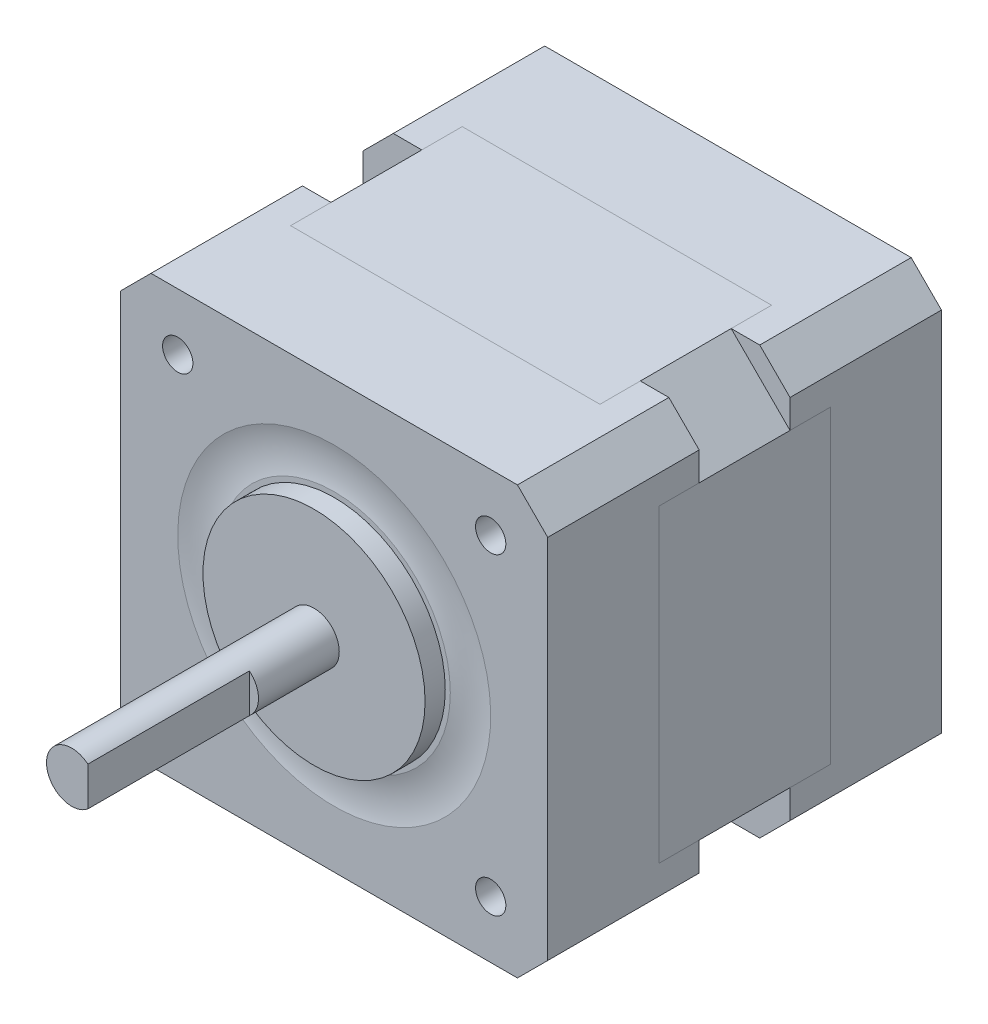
ISO-10303-21;
HEADER;
FILE_DESCRIPTION(('STEP AP214'),'2;1');
FILE_NAME('part.step','',(''),(''),'','','');
FILE_SCHEMA(('AUTOMOTIVE_DESIGN { 1 0 10303 214 1 1 1 1 }'));
ENDSEC;
DATA;
#1=APPLICATION_CONTEXT('core data for automotive mechanical design processes');
#2=APPLICATION_PROTOCOL_DEFINITION('international standard','automotive_design',2000,#1);
#3=PRODUCT_CONTEXT('',#1,'mechanical');
#4=PRODUCT('Part','Part','',(#3));
#5=PRODUCT_RELATED_PRODUCT_CATEGORY('part','',(#4));
#6=PRODUCT_DEFINITION_FORMATION('','',#4);
#7=PRODUCT_DEFINITION_CONTEXT('part definition',#1,'design');
#8=PRODUCT_DEFINITION('design','',#6,#7);
#9=PRODUCT_DEFINITION_SHAPE('','',#8);
#10=(LENGTH_UNIT() NAMED_UNIT(*) SI_UNIT(.MILLI.,.METRE.));
#11=(NAMED_UNIT(*) PLANE_ANGLE_UNIT() SI_UNIT($,.RADIAN.));
#12=(NAMED_UNIT(*) SI_UNIT($,.STERADIAN.) SOLID_ANGLE_UNIT());
#13=UNCERTAINTY_MEASURE_WITH_UNIT(LENGTH_MEASURE(1.E-05),#10,'distance_accuracy_value','');
#14=(GEOMETRIC_REPRESENTATION_CONTEXT(3) GLOBAL_UNCERTAINTY_ASSIGNED_CONTEXT((#13)) GLOBAL_UNIT_ASSIGNED_CONTEXT((#10,
#11,#12)) REPRESENTATION_CONTEXT('',''));
#15=CARTESIAN_POINT('',(0.,0.,0.));
#16=DIRECTION('',(0.,0.,1.));
#17=DIRECTION('',(1.,0.,0.));
#18=AXIS2_PLACEMENT_3D('',#15,#16,#17);
#19=CARTESIAN_POINT('',(0.,0.,1.));
#20=DIRECTION('',(0.,0.,1.));
#21=DIRECTION('',(1.,0.,0.));
#22=AXIS2_PLACEMENT_3D('',#19,#20,#21);
#23=CYLINDRICAL_SURFACE('',#22,2.5);
#24=CARTESIAN_POINT('',(0.,0.,1.));
#25=DIRECTION('',(0.,0.,-1.));
#26=DIRECTION('',(-1.,0.,0.));
#27=AXIS2_PLACEMENT_3D('',#24,#25,#26);
#28=CIRCLE('',#27,2.5);
#29=CARTESIAN_POINT('',(-2.5,0.,1.));
#30=VERTEX_POINT('',#29);
#31=EDGE_CURVE('E11',#30,#30,#28,.T.);
#32=ORIENTED_EDGE('',*,*,#31,.F.);
#33=EDGE_LOOP('',(#32));
#34=FACE_BOUND('',#33,.T.);
#35=CARTESIAN_POINT('',(0.,0.,2.));
#36=DIRECTION('',(0.,0.,-1.));
#37=DIRECTION('',(-1.,0.,0.));
#38=AXIS2_PLACEMENT_3D('',#35,#36,#37);
#39=CIRCLE('',#38,2.5);
#40=CARTESIAN_POINT('',(-2.5,0.,2.));
#41=VERTEX_POINT('',#40);
#42=EDGE_CURVE('E44',#41,#41,#39,.T.);
#43=ORIENTED_EDGE('',*,*,#42,.T.);
#44=EDGE_LOOP('',(#43));
#45=FACE_BOUND('',#44,.T.);
#46=ADVANCED_FACE('F41',(#34,#45),#23,.T.);
#47=CARTESIAN_POINT('',(0.,0.,1.));
#48=DIRECTION('',(0.,0.,-1.));
#49=DIRECTION('',(-1.,0.,0.));
#50=AXIS2_PLACEMENT_3D('',#47,#48,#49);
#51=PLANE('',#50);
#52=ORIENTED_EDGE('',*,*,#31,.T.);
#53=EDGE_LOOP('',(#52));
#54=FACE_BOUND('',#53,.T.);
#55=ADVANCED_FACE('F56',(#54),#51,.T.);
#56=CARTESIAN_POINT('',(0.,0.,2.));
#57=DIRECTION('',(0.,0.,-1.));
#58=DIRECTION('',(-1.,0.,0.));
#59=AXIS2_PLACEMENT_3D('',#56,#57,#58);
#60=PLANE('',#59);
#61=ORIENTED_EDGE('',*,*,#42,.F.);
#62=EDGE_LOOP('',(#61));
#63=FACE_BOUND('',#62,.T.);
#64=ADVANCED_FACE('F54',(#63),#60,.F.);
#65=CLOSED_SHELL('',(#46,#55,#64));
#66=MANIFOLD_SOLID_BREP('B2',#65);
#67=CARTESIAN_POINT('',(0.,0.,65.));
#68=DIRECTION('',(0.,0.,-1.));
#69=DIRECTION('',(-1.,0.,0.));
#70=AXIS2_PLACEMENT_3D('',#67,#68,#69);
#71=CYLINDRICAL_SURFACE('',#70,2.5);
#72=CARTESIAN_POINT('',(0.,0.,65.));
#73=DIRECTION('',(0.,0.,1.));
#74=DIRECTION('',(1.,0.,0.));
#75=AXIS2_PLACEMENT_3D('',#72,#73,#74);
#76=CIRCLE('',#75,2.5);
#77=CARTESIAN_POINT('',(1.6,1.92093727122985,65.));
#78=VERTEX_POINT('',#77);
#79=CARTESIAN_POINT('',(1.6,-1.92093727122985,65.));
#80=VERTEX_POINT('',#79);
#81=EDGE_CURVE('E39',#78,#80,#76,.T.);
#82=ORIENTED_EDGE('',*,*,#81,.F.);
#83=DIRECTION('',(0.,0.,1.));
#84=VECTOR('',#83,1.);
#85=CARTESIAN_POINT('',(1.6,1.92093727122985,49.));
#86=LINE('',#85,#84);
#87=CARTESIAN_POINT('',(1.6,1.92093727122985,49.));
#88=VERTEX_POINT('',#87);
#89=EDGE_CURVE('E103',#88,#78,#86,.T.);
#90=ORIENTED_EDGE('',*,*,#89,.F.);
#91=CARTESIAN_POINT('',(0.,0.,49.));
#92=DIRECTION('',(0.,0.,1.));
#93=DIRECTION('',(1.,0.,0.));
#94=AXIS2_PLACEMENT_3D('',#91,#92,#93);
#95=CIRCLE('',#94,2.5);
#96=CARTESIAN_POINT('',(1.6,-1.92093727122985,49.));
#97=VERTEX_POINT('',#96);
#98=EDGE_CURVE('E118',#97,#88,#95,.T.);
#99=ORIENTED_EDGE('',*,*,#98,.F.);
#100=DIRECTION('',(0.,0.,1.));
#101=VECTOR('',#100,1.);
#102=CARTESIAN_POINT('',(1.6,-1.92093727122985,49.));
#103=LINE('',#102,#101);
#104=EDGE_CURVE('E109',#97,#80,#103,.T.);
#105=ORIENTED_EDGE('',*,*,#104,.T.);
#106=EDGE_LOOP('',(#82,#90,#99,#105));
#107=FACE_BOUND('',#106,.T.);
#108=CARTESIAN_POINT('',(0.,0.,41.));
#109=DIRECTION('',(0.,0.,1.));
#110=DIRECTION('',(1.,0.,0.));
#111=AXIS2_PLACEMENT_3D('',#108,#109,#110);
#112=CIRCLE('',#111,2.5);
#113=CARTESIAN_POINT('',(2.5,0.,41.));
#114=VERTEX_POINT('',#113);
#115=EDGE_CURVE('E92',#114,#114,#112,.T.);
#116=ORIENTED_EDGE('',*,*,#115,.T.);
#117=EDGE_LOOP('',(#116));
#118=FACE_BOUND('',#117,.T.);
#119=ADVANCED_FACE('F89',(#107,#118),#71,.T.);
#120=CARTESIAN_POINT('',(0.,0.,65.));
#121=DIRECTION('',(0.,0.,1.));
#122=DIRECTION('',(1.,0.,0.));
#123=AXIS2_PLACEMENT_3D('',#120,#121,#122);
#124=PLANE('',#123);
#125=DIRECTION('',(0.,-1.,0.));
#126=VECTOR('',#125,1.);
#127=CARTESIAN_POINT('',(1.6,1.92093727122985,65.));
#128=LINE('',#127,#126);
#129=EDGE_CURVE('E114',#78,#80,#128,.T.);
#130=ORIENTED_EDGE('',*,*,#129,.F.);
#131=ORIENTED_EDGE('',*,*,#81,.T.);
#132=EDGE_LOOP('',(#130,#131));
#133=FACE_BOUND('',#132,.T.);
#134=ADVANCED_FACE('F124',(#133),#124,.T.);
#135=CARTESIAN_POINT('',(0.,0.,41.));
#136=DIRECTION('',(0.,0.,1.));
#137=DIRECTION('',(1.,0.,0.));
#138=AXIS2_PLACEMENT_3D('',#135,#136,#137);
#139=PLANE('',#138);
#140=ORIENTED_EDGE('',*,*,#115,.F.);
#141=EDGE_LOOP('',(#140));
#142=FACE_BOUND('',#141,.T.);
#143=ADVANCED_FACE('F126',(#142),#139,.F.);
#144=CARTESIAN_POINT('',(1.6,1.92093727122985,49.));
#145=DIRECTION('',(-1.,0.,0.));
#146=DIRECTION('',(0.,0.,1.));
#147=AXIS2_PLACEMENT_3D('',#144,#145,#146);
#148=PLANE('',#147);
#149=ORIENTED_EDGE('',*,*,#129,.T.);
#150=ORIENTED_EDGE('',*,*,#104,.F.);
#151=DIRECTION('',(0.,-1.,0.));
#152=VECTOR('',#151,1.);
#153=CARTESIAN_POINT('',(1.6,1.92093727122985,49.));
#154=LINE('',#153,#152);
#155=EDGE_CURVE('E141',#88,#97,#154,.T.);
#156=ORIENTED_EDGE('',*,*,#155,.F.);
#157=ORIENTED_EDGE('',*,*,#89,.T.);
#158=EDGE_LOOP('',(#149,#150,#156,#157));
#159=FACE_BOUND('',#158,.T.);
#160=ADVANCED_FACE('F115',(#159),#148,.F.);
#161=CARTESIAN_POINT('',(0.,0.,49.));
#162=DIRECTION('',(0.,0.,1.));
#163=DIRECTION('',(1.,0.,0.));
#164=AXIS2_PLACEMENT_3D('',#161,#162,#163);
#165=PLANE('',#164);
#166=ORIENTED_EDGE('',*,*,#98,.T.);
#167=ORIENTED_EDGE('',*,*,#155,.T.);
#168=EDGE_LOOP('',(#166,#167));
#169=FACE_BOUND('',#168,.T.);
#170=ADVANCED_FACE('F136',(#169),#165,.T.);
#171=CLOSED_SHELL('',(#119,#134,#143,#160,#170));
#172=MANIFOLD_SOLID_BREP('B6',#171);
#173=CARTESIAN_POINT('',(0.,0.,41.));
#174=DIRECTION('',(0.,0.,-1.));
#175=DIRECTION('',(-1.,0.,0.));
#176=AXIS2_PLACEMENT_3D('',#173,#174,#175);
#177=CYLINDRICAL_SURFACE('',#176,11.);
#178=CARTESIAN_POINT('',(0.,0.,41.));
#179=DIRECTION('',(0.,0.,1.));
#180=DIRECTION('',(1.,0.,0.));
#181=AXIS2_PLACEMENT_3D('',#178,#179,#180);
#182=CIRCLE('',#181,11.);
#183=CARTESIAN_POINT('',(11.,0.,41.));
#184=VERTEX_POINT('',#183);
#185=EDGE_CURVE('E88',#184,#184,#182,.T.);
#186=ORIENTED_EDGE('',*,*,#185,.F.);
#187=EDGE_LOOP('',(#186));
#188=FACE_BOUND('',#187,.T.);
#189=CARTESIAN_POINT('',(0.,0.,39.));
#190=DIRECTION('',(0.,0.,1.));
#191=DIRECTION('',(1.,0.,0.));
#192=AXIS2_PLACEMENT_3D('',#189,#190,#191);
#193=CIRCLE('',#192,11.);
#194=CARTESIAN_POINT('',(11.,0.,39.));
#195=VERTEX_POINT('',#194);
#196=EDGE_CURVE('E188',#195,#195,#193,.T.);
#197=ORIENTED_EDGE('',*,*,#196,.T.);
#198=EDGE_LOOP('',(#197));
#199=FACE_BOUND('',#198,.T.);
#200=ADVANCED_FACE('F185',(#188,#199),#177,.T.);
#201=CARTESIAN_POINT('',(0.,0.,41.));
#202=DIRECTION('',(0.,0.,1.));
#203=DIRECTION('',(1.,0.,0.));
#204=AXIS2_PLACEMENT_3D('',#201,#202,#203);
#205=PLANE('',#204);
#206=ORIENTED_EDGE('',*,*,#185,.T.);
#207=EDGE_LOOP('',(#206));
#208=FACE_BOUND('',#207,.T.);
#209=ADVANCED_FACE('F200',(#208),#205,.T.);
#210=CARTESIAN_POINT('',(0.,0.,39.));
#211=DIRECTION('',(0.,0.,1.));
#212=DIRECTION('',(1.,0.,0.));
#213=AXIS2_PLACEMENT_3D('',#210,#211,#212);
#214=PLANE('',#213);
#215=ORIENTED_EDGE('',*,*,#196,.F.);
#216=EDGE_LOOP('',(#215));
#217=FACE_BOUND('',#216,.T.);
#218=ADVANCED_FACE('F198',(#217),#214,.F.);
#219=CLOSED_SHELL('',(#200,#209,#218));
#220=MANIFOLD_SOLID_BREP('B33',#219);
#221=CARTESIAN_POINT('',(-15.321572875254,-21.1499999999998,28.));
#222=DIRECTION('',(0.,1.,0.));
#223=DIRECTION('',(-1.,0.,0.));
#224=AXIS2_PLACEMENT_3D('',#221,#222,#223);
#225=PLANE('',#224);
#226=DIRECTION('',(1.,0.,0.));
#227=VECTOR('',#226,1.);
#228=CARTESIAN_POINT('',(-15.321572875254,-21.1499999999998,11.));
#229=LINE('',#228,#227);
#230=CARTESIAN_POINT('',(-15.321572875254,-21.1499999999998,11.));
#231=VERTEX_POINT('',#230);
#232=CARTESIAN_POINT('',(15.3215728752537,-21.1500000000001,11.));
#233=VERTEX_POINT('',#232);
#234=EDGE_CURVE('E331',#231,#233,#229,.T.);
#235=ORIENTED_EDGE('',*,*,#234,.T.);
#236=DIRECTION('',(0.,0.,-1.));
#237=VECTOR('',#236,1.);
#238=CARTESIAN_POINT('',(15.3215728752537,-21.1500000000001,28.));
#239=LINE('',#238,#237);
#240=CARTESIAN_POINT('',(15.3215728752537,-21.1500000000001,28.));
#241=VERTEX_POINT('',#240);
#242=EDGE_CURVE('E183',#241,#233,#239,.T.);
#243=ORIENTED_EDGE('',*,*,#242,.F.);
#244=DIRECTION('',(1.,0.,0.));
#245=VECTOR('',#244,1.);
#246=CARTESIAN_POINT('',(-15.321572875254,-21.1499999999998,28.));
#247=LINE('',#246,#245);
#248=CARTESIAN_POINT('',(-15.321572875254,-21.1499999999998,28.));
#249=VERTEX_POINT('',#248);
#250=EDGE_CURVE('E345',#249,#241,#247,.T.);
#251=ORIENTED_EDGE('',*,*,#250,.F.);
#252=DIRECTION('',(0.,0.,-1.));
#253=VECTOR('',#252,1.);
#254=CARTESIAN_POINT('',(-15.321572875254,-21.1499999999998,28.));
#255=LINE('',#254,#253);
#256=EDGE_CURVE('E327',#249,#231,#255,.T.);
#257=ORIENTED_EDGE('',*,*,#256,.T.);
#258=EDGE_LOOP('',(#235,#243,#251,#257));
#259=FACE_BOUND('',#258,.T.);
#260=ADVANCED_FACE('F235',(#259),#225,.F.);
#261=CARTESIAN_POINT('',(15.3215728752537,-21.1500000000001,28.));
#262=DIRECTION('',(-0.707106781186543,0.707106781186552,0.));
#263=DIRECTION('',(-0.707106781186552,-0.707106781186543,0.));
#264=AXIS2_PLACEMENT_3D('',#261,#262,#263);
#265=PLANE('',#264);
#266=DIRECTION('',(0.707106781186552,0.707106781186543,0.));
#267=VECTOR('',#266,1.);
#268=CARTESIAN_POINT('',(15.3215728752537,-21.1500000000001,11.));
#269=LINE('',#268,#267);
#270=CARTESIAN_POINT('',(21.1499999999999,-15.321572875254,11.));
#271=VERTEX_POINT('',#270);
#272=EDGE_CURVE('E334',#233,#271,#269,.T.);
#273=ORIENTED_EDGE('',*,*,#272,.T.);
#274=DIRECTION('',(0.,0.,-1.));
#275=VECTOR('',#274,1.);
#276=CARTESIAN_POINT('',(21.1499999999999,-15.321572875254,28.));
#277=LINE('',#276,#275);
#278=CARTESIAN_POINT('',(21.1499999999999,-15.321572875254,28.));
#279=VERTEX_POINT('',#278);
#280=EDGE_CURVE('E243',#279,#271,#277,.T.);
#281=ORIENTED_EDGE('',*,*,#280,.F.);
#282=DIRECTION('',(0.707106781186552,0.707106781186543,0.));
#283=VECTOR('',#282,1.);
#284=CARTESIAN_POINT('',(15.3215728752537,-21.1500000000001,28.));
#285=LINE('',#284,#283);
#286=EDGE_CURVE('E294',#241,#279,#285,.T.);
#287=ORIENTED_EDGE('',*,*,#286,.F.);
#288=ORIENTED_EDGE('',*,*,#242,.T.);
#289=EDGE_LOOP('',(#273,#281,#287,#288));
#290=FACE_BOUND('',#289,.T.);
#291=ADVANCED_FACE('F380',(#290),#265,.F.);
#292=CARTESIAN_POINT('',(21.1499999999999,-15.321572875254,28.));
#293=DIRECTION('',(-1.,0.,0.));
#294=DIRECTION('',(0.,-1.,0.));
#295=AXIS2_PLACEMENT_3D('',#292,#293,#294);
#296=PLANE('',#295);
#297=DIRECTION('',(0.,1.,0.));
#298=VECTOR('',#297,1.);
#299=CARTESIAN_POINT('',(21.1499999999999,-15.321572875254,11.));
#300=LINE('',#299,#298);
#301=CARTESIAN_POINT('',(21.15,15.3215728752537,11.));
#302=VERTEX_POINT('',#301);
#303=EDGE_CURVE('E336',#271,#302,#300,.T.);
#304=ORIENTED_EDGE('',*,*,#303,.T.);
#305=DIRECTION('',(0.,0.,-1.));
#306=VECTOR('',#305,1.);
#307=CARTESIAN_POINT('',(21.15,15.3215728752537,28.));
#308=LINE('',#307,#306);
#309=CARTESIAN_POINT('',(21.15,15.3215728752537,28.));
#310=VERTEX_POINT('',#309);
#311=EDGE_CURVE('E352',#310,#302,#308,.T.);
#312=ORIENTED_EDGE('',*,*,#311,.F.);
#313=DIRECTION('',(0.,1.,0.));
#314=VECTOR('',#313,1.);
#315=CARTESIAN_POINT('',(21.1499999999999,-15.321572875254,28.));
#316=LINE('',#315,#314);
#317=EDGE_CURVE('E360',#279,#310,#316,.T.);
#318=ORIENTED_EDGE('',*,*,#317,.F.);
#319=ORIENTED_EDGE('',*,*,#280,.T.);
#320=EDGE_LOOP('',(#304,#312,#318,#319));
#321=FACE_BOUND('',#320,.T.);
#322=ADVANCED_FACE('F358',(#321),#296,.F.);
#323=CARTESIAN_POINT('',(21.15,15.3215728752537,28.));
#324=DIRECTION('',(-0.70710678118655,-0.707106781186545,0.));
#325=DIRECTION('',(0.707106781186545,-0.70710678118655,0.));
#326=AXIS2_PLACEMENT_3D('',#323,#324,#325);
#327=PLANE('',#326);
#328=DIRECTION('',(-0.707106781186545,0.70710678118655,0.));
#329=VECTOR('',#328,1.);
#330=CARTESIAN_POINT('',(21.15,15.3215728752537,11.));
#331=LINE('',#330,#329);
#332=CARTESIAN_POINT('',(15.3215728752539,21.1499999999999,11.));
#333=VERTEX_POINT('',#332);
#334=EDGE_CURVE('E338',#302,#333,#331,.T.);
#335=ORIENTED_EDGE('',*,*,#334,.T.);
#336=DIRECTION('',(0.,0.,-1.));
#337=VECTOR('',#336,1.);
#338=CARTESIAN_POINT('',(15.3215728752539,21.1499999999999,28.));
#339=LINE('',#338,#337);
#340=CARTESIAN_POINT('',(15.3215728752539,21.1499999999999,28.));
#341=VERTEX_POINT('',#340);
#342=EDGE_CURVE('E349',#341,#333,#339,.T.);
#343=ORIENTED_EDGE('',*,*,#342,.F.);
#344=DIRECTION('',(-0.707106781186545,0.70710678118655,0.));
#345=VECTOR('',#344,1.);
#346=CARTESIAN_POINT('',(21.15,15.3215728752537,28.));
#347=LINE('',#346,#345);
#348=EDGE_CURVE('E372',#310,#341,#347,.T.);
#349=ORIENTED_EDGE('',*,*,#348,.F.);
#350=ORIENTED_EDGE('',*,*,#311,.T.);
#351=EDGE_LOOP('',(#335,#343,#349,#350));
#352=FACE_BOUND('',#351,.T.);
#353=ADVANCED_FACE('F368',(#352),#327,.F.);
#354=CARTESIAN_POINT('',(15.3215728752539,21.1499999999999,28.));
#355=DIRECTION('',(0.,-1.,0.));
#356=DIRECTION('',(1.,0.,0.));
#357=AXIS2_PLACEMENT_3D('',#354,#355,#356);
#358=PLANE('',#357);
#359=DIRECTION('',(-1.,0.,0.));
#360=VECTOR('',#359,1.);
#361=CARTESIAN_POINT('',(15.3215728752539,21.1499999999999,11.));
#362=LINE('',#361,#360);
#363=CARTESIAN_POINT('',(-15.3215728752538,21.15,11.));
#364=VERTEX_POINT('',#363);
#365=EDGE_CURVE('E340',#333,#364,#362,.T.);
#366=ORIENTED_EDGE('',*,*,#365,.T.);
#367=DIRECTION('',(0.,0.,-1.));
#368=VECTOR('',#367,1.);
#369=CARTESIAN_POINT('',(-15.3215728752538,21.15,28.));
#370=LINE('',#369,#368);
#371=CARTESIAN_POINT('',(-15.3215728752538,21.15,28.));
#372=VERTEX_POINT('',#371);
#373=EDGE_CURVE('E322',#372,#364,#370,.T.);
#374=ORIENTED_EDGE('',*,*,#373,.F.);
#375=DIRECTION('',(-1.,0.,0.));
#376=VECTOR('',#375,1.);
#377=CARTESIAN_POINT('',(15.3215728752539,21.1499999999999,28.));
#378=LINE('',#377,#376);
#379=EDGE_CURVE('E313',#341,#372,#378,.T.);
#380=ORIENTED_EDGE('',*,*,#379,.F.);
#381=ORIENTED_EDGE('',*,*,#342,.T.);
#382=EDGE_LOOP('',(#366,#374,#380,#381));
#383=FACE_BOUND('',#382,.T.);
#384=ADVANCED_FACE('F371',(#383),#358,.F.);
#385=CARTESIAN_POINT('',(-15.3215728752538,21.15,28.));
#386=DIRECTION('',(0.707106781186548,-0.707106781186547,0.));
#387=DIRECTION('',(0.707106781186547,0.707106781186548,0.));
#388=AXIS2_PLACEMENT_3D('',#385,#386,#387);
#389=PLANE('',#388);
#390=DIRECTION('',(-0.707106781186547,-0.707106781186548,0.));
#391=VECTOR('',#390,1.);
#392=CARTESIAN_POINT('',(-15.3215728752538,21.15,11.));
#393=LINE('',#392,#391);
#394=CARTESIAN_POINT('',(-21.15,15.3215728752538,11.));
#395=VERTEX_POINT('',#394);
#396=EDGE_CURVE('E321',#364,#395,#393,.T.);
#397=ORIENTED_EDGE('',*,*,#396,.T.);
#398=DIRECTION('',(0.,0.,-1.));
#399=VECTOR('',#398,1.);
#400=CARTESIAN_POINT('',(-21.15,15.3215728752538,28.));
#401=LINE('',#400,#399);
#402=CARTESIAN_POINT('',(-21.15,15.3215728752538,28.));
#403=VERTEX_POINT('',#402);
#404=EDGE_CURVE('E318',#403,#395,#401,.T.);
#405=ORIENTED_EDGE('',*,*,#404,.F.);
#406=DIRECTION('',(-0.707106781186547,-0.707106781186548,0.));
#407=VECTOR('',#406,1.);
#408=CARTESIAN_POINT('',(-15.3215728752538,21.15,28.));
#409=LINE('',#408,#407);
#410=EDGE_CURVE('E307',#372,#403,#409,.T.);
#411=ORIENTED_EDGE('',*,*,#410,.F.);
#412=ORIENTED_EDGE('',*,*,#373,.T.);
#413=EDGE_LOOP('',(#397,#405,#411,#412));
#414=FACE_BOUND('',#413,.T.);
#415=ADVANCED_FACE('F319',(#414),#389,.F.);
#416=CARTESIAN_POINT('',(-21.15,15.3215728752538,28.));
#417=DIRECTION('',(1.,0.,0.));
#418=DIRECTION('',(0.,1.,0.));
#419=AXIS2_PLACEMENT_3D('',#416,#417,#418);
#420=PLANE('',#419);
#421=DIRECTION('',(0.,-1.,0.));
#422=VECTOR('',#421,1.);
#423=CARTESIAN_POINT('',(-21.15,15.3215728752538,11.));
#424=LINE('',#423,#422);
#425=CARTESIAN_POINT('',(-21.1500000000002,-15.3215728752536,11.));
#426=VERTEX_POINT('',#425);
#427=EDGE_CURVE('E280',#395,#426,#424,.T.);
#428=ORIENTED_EDGE('',*,*,#427,.T.);
#429=DIRECTION('',(0.,0.,-1.));
#430=VECTOR('',#429,1.);
#431=CARTESIAN_POINT('',(-21.1500000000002,-15.3215728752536,28.));
#432=LINE('',#431,#430);
#433=CARTESIAN_POINT('',(-21.1500000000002,-15.3215728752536,28.));
#434=VERTEX_POINT('',#433);
#435=EDGE_CURVE('E323',#434,#426,#432,.T.);
#436=ORIENTED_EDGE('',*,*,#435,.F.);
#437=DIRECTION('',(0.,-1.,0.));
#438=VECTOR('',#437,1.);
#439=CARTESIAN_POINT('',(-21.15,15.3215728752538,28.));
#440=LINE('',#439,#438);
#441=EDGE_CURVE('E311',#403,#434,#440,.T.);
#442=ORIENTED_EDGE('',*,*,#441,.F.);
#443=ORIENTED_EDGE('',*,*,#404,.T.);
#444=EDGE_LOOP('',(#428,#436,#442,#443));
#445=FACE_BOUND('',#444,.T.);
#446=ADVANCED_FACE('F325',(#445),#420,.F.);
#447=CARTESIAN_POINT('',(-21.1500000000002,-15.3215728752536,28.));
#448=DIRECTION('',(0.707106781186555,0.70710678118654,0.));
#449=DIRECTION('',(-0.70710678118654,0.707106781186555,0.));
#450=AXIS2_PLACEMENT_3D('',#447,#448,#449);
#451=PLANE('',#450);
#452=DIRECTION('',(0.70710678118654,-0.707106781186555,0.));
#453=VECTOR('',#452,1.);
#454=CARTESIAN_POINT('',(-21.1500000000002,-15.3215728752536,11.));
#455=LINE('',#454,#453);
#456=EDGE_CURVE('E286',#426,#231,#455,.T.);
#457=ORIENTED_EDGE('',*,*,#456,.T.);
#458=ORIENTED_EDGE('',*,*,#256,.F.);
#459=DIRECTION('',(0.70710678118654,-0.707106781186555,0.));
#460=VECTOR('',#459,1.);
#461=CARTESIAN_POINT('',(-21.1500000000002,-15.3215728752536,28.));
#462=LINE('',#461,#460);
#463=EDGE_CURVE('E251',#434,#249,#462,.T.);
#464=ORIENTED_EDGE('',*,*,#463,.F.);
#465=ORIENTED_EDGE('',*,*,#435,.T.);
#466=EDGE_LOOP('',(#457,#458,#464,#465));
#467=FACE_BOUND('',#466,.T.);
#468=ADVANCED_FACE('F396',(#467),#451,.F.);
#469=CARTESIAN_POINT('',(0.,0.,28.));
#470=DIRECTION('',(0.,0.,1.));
#471=DIRECTION('',(1.,0.,0.));
#472=AXIS2_PLACEMENT_3D('',#469,#470,#471);
#473=PLANE('',#472);
#474=ORIENTED_EDGE('',*,*,#250,.T.);
#475=ORIENTED_EDGE('',*,*,#286,.T.);
#476=ORIENTED_EDGE('',*,*,#317,.T.);
#477=ORIENTED_EDGE('',*,*,#348,.T.);
#478=ORIENTED_EDGE('',*,*,#379,.T.);
#479=ORIENTED_EDGE('',*,*,#410,.T.);
#480=ORIENTED_EDGE('',*,*,#441,.T.);
#481=ORIENTED_EDGE('',*,*,#463,.T.);
#482=EDGE_LOOP('',(#474,#475,#476,#477,#478,#479,#480,#481));
#483=FACE_BOUND('',#482,.T.);
#484=ADVANCED_FACE('F309',(#483),#473,.T.);
#485=CARTESIAN_POINT('',(0.,0.,11.));
#486=DIRECTION('',(0.,0.,1.));
#487=DIRECTION('',(1.,0.,0.));
#488=AXIS2_PLACEMENT_3D('',#485,#486,#487);
#489=PLANE('',#488);
#490=ORIENTED_EDGE('',*,*,#234,.F.);
#491=ORIENTED_EDGE('',*,*,#456,.F.);
#492=ORIENTED_EDGE('',*,*,#427,.F.);
#493=ORIENTED_EDGE('',*,*,#396,.F.);
#494=ORIENTED_EDGE('',*,*,#365,.F.);
#495=ORIENTED_EDGE('',*,*,#334,.F.);
#496=ORIENTED_EDGE('',*,*,#303,.F.);
#497=ORIENTED_EDGE('',*,*,#272,.F.);
#498=EDGE_LOOP('',(#490,#491,#492,#493,#494,#495,#496,#497));
#499=FACE_BOUND('',#498,.T.);
#500=ADVANCED_FACE('F364',(#499),#489,.F.);
#501=CLOSED_SHELL('',(#260,#291,#322,#353,#384,#415,#446,#468,#484,#500));
#502=MANIFOLD_SOLID_BREP('B83',#501);
#503=CARTESIAN_POINT('',(0.,0.,39.));
#504=DIRECTION('',(0.,0.,-1.));
#505=DIRECTION('',(-1.,0.,0.));
#506=AXIS2_PLACEMENT_3D('',#503,#504,#505);
#507=PLANE('',#506);
#508=DIRECTION('',(0.,1.,0.));
#509=VECTOR('',#508,1.);
#510=CARTESIAN_POINT('',(-21.15,-18.15,39.));
#511=LINE('',#510,#509);
#512=CARTESIAN_POINT('',(-21.15,-18.15,39.));
#513=VERTEX_POINT('',#512);
#514=CARTESIAN_POINT('',(-21.15,18.15,39.));
#515=VERTEX_POINT('',#514);
#516=EDGE_CURVE('E590',#513,#515,#511,.T.);
#517=ORIENTED_EDGE('',*,*,#516,.F.);
#518=DIRECTION('',(-0.707106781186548,0.707106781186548,0.));
#519=VECTOR('',#518,1.);
#520=CARTESIAN_POINT('',(-18.15,-21.15,39.));
#521=LINE('',#520,#519);
#522=CARTESIAN_POINT('',(-18.15,-21.15,39.));
#523=VERTEX_POINT('',#522);
#524=EDGE_CURVE('E528',#523,#513,#521,.T.);
#525=ORIENTED_EDGE('',*,*,#524,.F.);
#526=DIRECTION('',(-1.,0.,0.));
#527=VECTOR('',#526,1.);
#528=CARTESIAN_POINT('',(18.15,-21.15,39.));
#529=LINE('',#528,#527);
#530=CARTESIAN_POINT('',(18.15,-21.15,39.));
#531=VERTEX_POINT('',#530);
#532=EDGE_CURVE('E602',#531,#523,#529,.T.);
#533=ORIENTED_EDGE('',*,*,#532,.F.);
#534=DIRECTION('',(-0.707106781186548,-0.707106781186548,0.));
#535=VECTOR('',#534,1.);
#536=CARTESIAN_POINT('',(21.15,-18.15,39.));
#537=LINE('',#536,#535);
#538=CARTESIAN_POINT('',(21.15,-18.15,39.));
#539=VERTEX_POINT('',#538);
#540=EDGE_CURVE('E574',#539,#531,#537,.T.);
#541=ORIENTED_EDGE('',*,*,#540,.F.);
#542=DIRECTION('',(0.,-1.,0.));
#543=VECTOR('',#542,1.);
#544=CARTESIAN_POINT('',(21.15,18.15,39.));
#545=LINE('',#544,#543);
#546=CARTESIAN_POINT('',(21.15,18.15,39.));
#547=VERTEX_POINT('',#546);
#548=EDGE_CURVE('E599',#547,#539,#545,.T.);
#549=ORIENTED_EDGE('',*,*,#548,.F.);
#550=DIRECTION('',(0.707106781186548,-0.707106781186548,0.));
#551=VECTOR('',#550,1.);
#552=CARTESIAN_POINT('',(18.15,21.15,39.));
#553=LINE('',#552,#551);
#554=CARTESIAN_POINT('',(18.15,21.15,39.));
#555=VERTEX_POINT('',#554);
#556=EDGE_CURVE('E597',#555,#547,#553,.T.);
#557=ORIENTED_EDGE('',*,*,#556,.F.);
#558=DIRECTION('',(1.,0.,0.));
#559=VECTOR('',#558,1.);
#560=CARTESIAN_POINT('',(-18.15,21.15,39.));
#561=LINE('',#560,#559);
#562=CARTESIAN_POINT('',(-18.15,21.15,39.));
#563=VERTEX_POINT('',#562);
#564=EDGE_CURVE('E595',#563,#555,#561,.T.);
#565=ORIENTED_EDGE('',*,*,#564,.F.);
#566=DIRECTION('',(0.707106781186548,0.707106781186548,0.));
#567=VECTOR('',#566,1.);
#568=CARTESIAN_POINT('',(-21.15,18.15,39.));
#569=LINE('',#568,#567);
#570=EDGE_CURVE('E593',#515,#563,#569,.T.);
#571=ORIENTED_EDGE('',*,*,#570,.F.);
#572=EDGE_LOOP('',(#517,#525,#533,#541,#549,#557,#565,#571));
#573=FACE_BOUND('',#572,.T.);
#574=CARTESIAN_POINT('',(-15.5,15.5,39.));
#575=DIRECTION('',(0.,0.,1.));
#576=DIRECTION('',(1.,0.,0.));
#577=AXIS2_PLACEMENT_3D('',#574,#575,#576);
#578=CIRCLE('',#577,1.5);
#579=CARTESIAN_POINT('',(-14.,15.5,39.));
#580=VERTEX_POINT('',#579);
#581=EDGE_CURVE('E707',#580,#580,#578,.T.);
#582=ORIENTED_EDGE('',*,*,#581,.F.);
#583=EDGE_LOOP('',(#582));
#584=FACE_BOUND('',#583,.T.);
#585=CARTESIAN_POINT('',(15.5,15.5,39.));
#586=DIRECTION('',(0.,0.,1.));
#587=DIRECTION('',(1.,0.,0.));
#588=AXIS2_PLACEMENT_3D('',#585,#586,#587);
#589=CIRCLE('',#588,1.5);
#590=CARTESIAN_POINT('',(17.,15.5,39.));
#591=VERTEX_POINT('',#590);
#592=EDGE_CURVE('E726',#591,#591,#589,.T.);
#593=ORIENTED_EDGE('',*,*,#592,.F.);
#594=EDGE_LOOP('',(#593));
#595=FACE_BOUND('',#594,.T.);
#596=CARTESIAN_POINT('',(15.5,-15.5,39.));
#597=DIRECTION('',(0.,0.,1.));
#598=DIRECTION('',(1.,0.,0.));
#599=AXIS2_PLACEMENT_3D('',#596,#597,#598);
#600=CIRCLE('',#599,1.5);
#601=CARTESIAN_POINT('',(17.,-15.5,39.));
#602=VERTEX_POINT('',#601);
#603=EDGE_CURVE('E720',#602,#602,#600,.T.);
#604=ORIENTED_EDGE('',*,*,#603,.F.);
#605=EDGE_LOOP('',(#604));
#606=FACE_BOUND('',#605,.T.);
#607=CARTESIAN_POINT('',(-15.5,-15.5,39.));
#608=DIRECTION('',(0.,0.,1.));
#609=DIRECTION('',(1.,0.,0.));
#610=AXIS2_PLACEMENT_3D('',#607,#608,#609);
#611=CIRCLE('',#610,1.5);
#612=CARTESIAN_POINT('',(-14.,-15.5,39.));
#613=VERTEX_POINT('',#612);
#614=EDGE_CURVE('E713',#613,#613,#611,.T.);
#615=ORIENTED_EDGE('',*,*,#614,.F.);
#616=EDGE_LOOP('',(#615));
#617=FACE_BOUND('',#616,.T.);
#618=CARTESIAN_POINT('',(0.,0.,39.));
#619=DIRECTION('',(0.,0.,-1.));
#620=DIRECTION('',(0.,1.,0.));
#621=AXIS2_PLACEMENT_3D('',#618,#619,#620);
#622=CIRCLE('',#621,15.5);
#623=CARTESIAN_POINT('',(0.,15.5,39.));
#624=VERTEX_POINT('',#623);
#625=EDGE_CURVE('E733',#624,#624,#622,.T.);
#626=ORIENTED_EDGE('',*,*,#625,.T.);
#627=EDGE_LOOP('',(#626));
#628=FACE_BOUND('',#627,.T.);
#629=ADVANCED_FACE('F471',(#573,#584,#595,#606,#617,#628),#507,.F.);
#630=CARTESIAN_POINT('',(0.,0.,24.));
#631=DIRECTION('',(0.,0.,-1.));
#632=DIRECTION('',(-1.,0.,0.));
#633=AXIS2_PLACEMENT_3D('',#630,#631,#632);
#634=PLANE('',#633);
#635=DIRECTION('',(-0.707106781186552,-0.707106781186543,0.));
#636=VECTOR('',#635,1.);
#637=CARTESIAN_POINT('',(21.1499999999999,-15.321572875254,24.));
#638=LINE('',#637,#636);
#639=CARTESIAN_POINT('',(21.1499999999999,-15.321572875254,24.));
#640=VERTEX_POINT('',#639);
#641=CARTESIAN_POINT('',(15.3215728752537,-21.1500000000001,24.));
#642=VERTEX_POINT('',#641);
#643=EDGE_CURVE('E672',#640,#642,#638,.T.);
#644=ORIENTED_EDGE('',*,*,#643,.F.);
#645=DIRECTION('',(0.,-1.,0.));
#646=VECTOR('',#645,1.);
#647=CARTESIAN_POINT('',(21.15,18.15,24.));
#648=LINE('',#647,#646);
#649=CARTESIAN_POINT('',(21.15,-18.15,24.));
#650=VERTEX_POINT('',#649);
#651=EDGE_CURVE('E563',#640,#650,#648,.T.);
#652=ORIENTED_EDGE('',*,*,#651,.T.);
#653=DIRECTION('',(-0.707106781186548,-0.707106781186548,0.));
#654=VECTOR('',#653,1.);
#655=CARTESIAN_POINT('',(21.15,-18.15,24.));
#656=LINE('',#655,#654);
#657=CARTESIAN_POINT('',(18.15,-21.15,24.));
#658=VERTEX_POINT('',#657);
#659=EDGE_CURVE('E556',#650,#658,#656,.T.);
#660=ORIENTED_EDGE('',*,*,#659,.T.);
#661=DIRECTION('',(-1.,0.,0.));
#662=VECTOR('',#661,1.);
#663=CARTESIAN_POINT('',(18.15,-21.15,24.));
#664=LINE('',#663,#662);
#665=EDGE_CURVE('E561',#658,#642,#664,.T.);
#666=ORIENTED_EDGE('',*,*,#665,.T.);
#667=EDGE_LOOP('',(#644,#652,#660,#666));
#668=FACE_BOUND('',#667,.T.);
#669=ADVANCED_FACE('F559',(#668),#634,.T.);
#670=DIRECTION('',(0.707106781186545,-0.70710678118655,0.));
#671=VECTOR('',#670,1.);
#672=CARTESIAN_POINT('',(15.3215728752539,21.1499999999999,24.));
#673=LINE('',#672,#671);
#674=CARTESIAN_POINT('',(15.3215728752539,21.1499999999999,24.));
#675=VERTEX_POINT('',#674);
#676=CARTESIAN_POINT('',(21.15,15.3215728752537,24.));
#677=VERTEX_POINT('',#676);
#678=EDGE_CURVE('E676',#675,#677,#673,.T.);
#679=ORIENTED_EDGE('',*,*,#678,.F.);
#680=DIRECTION('',(1.,0.,0.));
#681=VECTOR('',#680,1.);
#682=CARTESIAN_POINT('',(-18.15,21.15,24.));
#683=LINE('',#682,#681);
#684=CARTESIAN_POINT('',(18.15,21.15,24.));
#685=VERTEX_POINT('',#684);
#686=EDGE_CURVE('E649',#675,#685,#683,.T.);
#687=ORIENTED_EDGE('',*,*,#686,.T.);
#688=DIRECTION('',(0.707106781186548,-0.707106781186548,0.));
#689=VECTOR('',#688,1.);
#690=CARTESIAN_POINT('',(18.15,21.15,24.));
#691=LINE('',#690,#689);
#692=CARTESIAN_POINT('',(21.15,18.15,24.));
#693=VERTEX_POINT('',#692);
#694=EDGE_CURVE('E645',#685,#693,#691,.T.);
#695=ORIENTED_EDGE('',*,*,#694,.T.);
#696=EDGE_CURVE('E568',#693,#677,#648,.T.);
#697=ORIENTED_EDGE('',*,*,#696,.T.);
#698=EDGE_LOOP('',(#679,#687,#695,#697));
#699=FACE_BOUND('',#698,.T.);
#700=ADVANCED_FACE('F756',(#699),#634,.T.);
#701=DIRECTION('',(0.707106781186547,0.707106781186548,0.));
#702=VECTOR('',#701,1.);
#703=CARTESIAN_POINT('',(-21.15,15.3215728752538,24.));
#704=LINE('',#703,#702);
#705=CARTESIAN_POINT('',(-21.15,15.3215728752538,24.));
#706=VERTEX_POINT('',#705);
#707=CARTESIAN_POINT('',(-15.3215728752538,21.15,24.));
#708=VERTEX_POINT('',#707);
#709=EDGE_CURVE('E679',#706,#708,#704,.T.);
#710=ORIENTED_EDGE('',*,*,#709,.F.);
#711=DIRECTION('',(0.,1.,0.));
#712=VECTOR('',#711,1.);
#713=CARTESIAN_POINT('',(-21.15,-18.15,24.));
#714=LINE('',#713,#712);
#715=CARTESIAN_POINT('',(-21.15,18.15,24.));
#716=VERTEX_POINT('',#715);
#717=EDGE_CURVE('E537',#706,#716,#714,.T.);
#718=ORIENTED_EDGE('',*,*,#717,.T.);
#719=DIRECTION('',(0.707106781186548,0.707106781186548,0.));
#720=VECTOR('',#719,1.);
#721=CARTESIAN_POINT('',(-21.15,18.15,24.));
#722=LINE('',#721,#720);
#723=CARTESIAN_POINT('',(-18.15,21.15,24.));
#724=VERTEX_POINT('',#723);
#725=EDGE_CURVE('E650',#716,#724,#722,.T.);
#726=ORIENTED_EDGE('',*,*,#725,.T.);
#727=EDGE_CURVE('E623',#724,#708,#683,.T.);
#728=ORIENTED_EDGE('',*,*,#727,.T.);
#729=EDGE_LOOP('',(#710,#718,#726,#728));
#730=FACE_BOUND('',#729,.T.);
#731=ADVANCED_FACE('F761',(#730),#634,.T.);
#732=CARTESIAN_POINT('',(-21.15,-18.15,24.));
#733=DIRECTION('',(1.,0.,0.));
#734=DIRECTION('',(0.,0.,-1.));
#735=AXIS2_PLACEMENT_3D('',#732,#733,#734);
#736=PLANE('',#735);
#737=ORIENTED_EDGE('',*,*,#717,.F.);
#738=DIRECTION('',(0.,0.,-1.));
#739=VECTOR('',#738,1.);
#740=CARTESIAN_POINT('',(-21.15,15.3215728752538,28.));
#741=LINE('',#740,#739);
#742=CARTESIAN_POINT('',(-21.15,15.3215728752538,28.));
#743=VERTEX_POINT('',#742);
#744=EDGE_CURVE('E659',#743,#706,#741,.T.);
#745=ORIENTED_EDGE('',*,*,#744,.F.);
#746=DIRECTION('',(0.,1.,0.));
#747=VECTOR('',#746,1.);
#748=CARTESIAN_POINT('',(-21.1500000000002,-15.3215728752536,28.));
#749=LINE('',#748,#747);
#750=CARTESIAN_POINT('',(-21.1500000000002,-15.3215728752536,28.));
#751=VERTEX_POINT('',#750);
#752=EDGE_CURVE('E699',#751,#743,#749,.T.);
#753=ORIENTED_EDGE('',*,*,#752,.F.);
#754=DIRECTION('',(0.,0.,-1.));
#755=VECTOR('',#754,1.);
#756=CARTESIAN_POINT('',(-21.1500000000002,-15.3215728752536,28.));
#757=LINE('',#756,#755);
#758=CARTESIAN_POINT('',(-21.1500000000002,-15.3215728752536,24.));
#759=VERTEX_POINT('',#758);
#760=EDGE_CURVE('E655',#751,#759,#757,.T.);
#761=ORIENTED_EDGE('',*,*,#760,.T.);
#762=CARTESIAN_POINT('',(-21.15,-18.15,24.));
#763=VERTEX_POINT('',#762);
#764=EDGE_CURVE('E652',#763,#759,#714,.T.);
#765=ORIENTED_EDGE('',*,*,#764,.F.);
#766=DIRECTION('',(0.,0.,1.));
#767=VECTOR('',#766,1.);
#768=CARTESIAN_POINT('',(-21.15,-18.15,24.));
#769=LINE('',#768,#767);
#770=EDGE_CURVE('E586',#763,#513,#769,.T.);
#771=ORIENTED_EDGE('',*,*,#770,.T.);
#772=ORIENTED_EDGE('',*,*,#516,.T.);
#773=DIRECTION('',(0.,0.,1.));
#774=VECTOR('',#773,1.);
#775=CARTESIAN_POINT('',(-21.15,18.15,24.));
#776=LINE('',#775,#774);
#777=EDGE_CURVE('E233',#716,#515,#776,.T.);
#778=ORIENTED_EDGE('',*,*,#777,.F.);
#779=EDGE_LOOP('',(#737,#745,#753,#761,#765,#771,#772,#778));
#780=FACE_BOUND('',#779,.T.);
#781=ADVANCED_FACE('F473',(#780),#736,.F.);
#782=CARTESIAN_POINT('',(-21.15,18.15,24.));
#783=DIRECTION('',(0.707106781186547,-0.707106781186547,0.));
#784=DIRECTION('',(0.707106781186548,0.707106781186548,0.));
#785=AXIS2_PLACEMENT_3D('',#782,#783,#784);
#786=PLANE('',#785);
#787=ORIENTED_EDGE('',*,*,#570,.T.);
#788=DIRECTION('',(0.,0.,1.));
#789=VECTOR('',#788,1.);
#790=CARTESIAN_POINT('',(-18.15,21.15,24.));
#791=LINE('',#790,#789);
#792=EDGE_CURVE('E479',#724,#563,#791,.T.);
#793=ORIENTED_EDGE('',*,*,#792,.F.);
#794=ORIENTED_EDGE('',*,*,#725,.F.);
#795=ORIENTED_EDGE('',*,*,#777,.T.);
#796=EDGE_LOOP('',(#787,#793,#794,#795));
#797=FACE_BOUND('',#796,.T.);
#798=ADVANCED_FACE('F777',(#797),#786,.F.);
#799=CARTESIAN_POINT('',(-18.15,21.15,24.));
#800=DIRECTION('',(0.,-1.,0.));
#801=DIRECTION('',(0.,0.,-1.));
#802=AXIS2_PLACEMENT_3D('',#799,#800,#801);
#803=PLANE('',#802);
#804=ORIENTED_EDGE('',*,*,#686,.F.);
#805=DIRECTION('',(0.,0.,-1.));
#806=VECTOR('',#805,1.);
#807=CARTESIAN_POINT('',(15.3215728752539,21.1499999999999,28.));
#808=LINE('',#807,#806);
#809=CARTESIAN_POINT('',(15.3215728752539,21.1499999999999,28.));
#810=VERTEX_POINT('',#809);
#811=EDGE_CURVE('E664',#810,#675,#808,.T.);
#812=ORIENTED_EDGE('',*,*,#811,.F.);
#813=DIRECTION('',(1.,0.,0.));
#814=VECTOR('',#813,1.);
#815=CARTESIAN_POINT('',(-15.3215728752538,21.15,28.));
#816=LINE('',#815,#814);
#817=CARTESIAN_POINT('',(-15.3215728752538,21.15,28.));
#818=VERTEX_POINT('',#817);
#819=EDGE_CURVE('E693',#818,#810,#816,.T.);
#820=ORIENTED_EDGE('',*,*,#819,.F.);
#821=DIRECTION('',(0.,0.,-1.));
#822=VECTOR('',#821,1.);
#823=CARTESIAN_POINT('',(-15.3215728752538,21.15,28.));
#824=LINE('',#823,#822);
#825=EDGE_CURVE('E662',#818,#708,#824,.T.);
#826=ORIENTED_EDGE('',*,*,#825,.T.);
#827=ORIENTED_EDGE('',*,*,#727,.F.);
#828=ORIENTED_EDGE('',*,*,#792,.T.);
#829=ORIENTED_EDGE('',*,*,#564,.T.);
#830=DIRECTION('',(0.,0.,1.));
#831=VECTOR('',#830,1.);
#832=CARTESIAN_POINT('',(18.15,21.15,24.));
#833=LINE('',#832,#831);
#834=EDGE_CURVE('E611',#685,#555,#833,.T.);
#835=ORIENTED_EDGE('',*,*,#834,.F.);
#836=EDGE_LOOP('',(#804,#812,#820,#826,#827,#828,#829,#835));
#837=FACE_BOUND('',#836,.T.);
#838=ADVANCED_FACE('F619',(#837),#803,.F.);
#839=CARTESIAN_POINT('',(18.15,21.15,24.));
#840=DIRECTION('',(-0.707106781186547,-0.707106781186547,0.));
#841=DIRECTION('',(0.707106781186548,-0.707106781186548,0.));
#842=AXIS2_PLACEMENT_3D('',#839,#840,#841);
#843=PLANE('',#842);
#844=ORIENTED_EDGE('',*,*,#556,.T.);
#845=DIRECTION('',(0.,0.,1.));
#846=VECTOR('',#845,1.);
#847=CARTESIAN_POINT('',(21.15,18.15,24.));
#848=LINE('',#847,#846);
#849=EDGE_CURVE('E608',#693,#547,#848,.T.);
#850=ORIENTED_EDGE('',*,*,#849,.F.);
#851=ORIENTED_EDGE('',*,*,#694,.F.);
#852=ORIENTED_EDGE('',*,*,#834,.T.);
#853=EDGE_LOOP('',(#844,#850,#851,#852));
#854=FACE_BOUND('',#853,.T.);
#855=ADVANCED_FACE('F632',(#854),#843,.F.);
#856=CARTESIAN_POINT('',(21.15,18.15,24.));
#857=DIRECTION('',(-1.,0.,0.));
#858=DIRECTION('',(0.,0.,1.));
#859=AXIS2_PLACEMENT_3D('',#856,#857,#858);
#860=PLANE('',#859);
#861=ORIENTED_EDGE('',*,*,#651,.F.);
#862=DIRECTION('',(0.,0.,-1.));
#863=VECTOR('',#862,1.);
#864=CARTESIAN_POINT('',(21.1499999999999,-15.321572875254,28.));
#865=LINE('',#864,#863);
#866=CARTESIAN_POINT('',(21.1499999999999,-15.321572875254,28.));
#867=VERTEX_POINT('',#866);
#868=EDGE_CURVE('E668',#867,#640,#865,.T.);
#869=ORIENTED_EDGE('',*,*,#868,.F.);
#870=DIRECTION('',(0.,-1.,0.));
#871=VECTOR('',#870,1.);
#872=CARTESIAN_POINT('',(21.15,15.3215728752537,28.));
#873=LINE('',#872,#871);
#874=CARTESIAN_POINT('',(21.15,15.3215728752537,28.));
#875=VERTEX_POINT('',#874);
#876=EDGE_CURVE('E687',#875,#867,#873,.T.);
#877=ORIENTED_EDGE('',*,*,#876,.F.);
#878=DIRECTION('',(0.,0.,-1.));
#879=VECTOR('',#878,1.);
#880=CARTESIAN_POINT('',(21.15,15.3215728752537,28.));
#881=LINE('',#880,#879);
#882=EDGE_CURVE('E642',#875,#677,#881,.T.);
#883=ORIENTED_EDGE('',*,*,#882,.T.);
#884=ORIENTED_EDGE('',*,*,#696,.F.);
#885=ORIENTED_EDGE('',*,*,#849,.T.);
#886=ORIENTED_EDGE('',*,*,#548,.T.);
#887=DIRECTION('',(0.,0.,1.));
#888=VECTOR('',#887,1.);
#889=CARTESIAN_POINT('',(21.15,-18.15,24.));
#890=LINE('',#889,#888);
#891=EDGE_CURVE('E577',#650,#539,#890,.T.);
#892=ORIENTED_EDGE('',*,*,#891,.F.);
#893=EDGE_LOOP('',(#861,#869,#877,#883,#884,#885,#886,#892));
#894=FACE_BOUND('',#893,.T.);
#895=ADVANCED_FACE('F636',(#894),#860,.F.);
#896=CARTESIAN_POINT('',(21.15,-18.15,24.));
#897=DIRECTION('',(-0.707106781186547,0.707106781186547,0.));
#898=DIRECTION('',(-0.707106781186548,-0.707106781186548,0.));
#899=AXIS2_PLACEMENT_3D('',#896,#897,#898);
#900=PLANE('',#899);
#901=ORIENTED_EDGE('',*,*,#540,.T.);
#902=DIRECTION('',(0.,0.,1.));
#903=VECTOR('',#902,1.);
#904=CARTESIAN_POINT('',(18.15,-21.15,24.));
#905=LINE('',#904,#903);
#906=EDGE_CURVE('E571',#658,#531,#905,.T.);
#907=ORIENTED_EDGE('',*,*,#906,.F.);
#908=ORIENTED_EDGE('',*,*,#659,.F.);
#909=ORIENTED_EDGE('',*,*,#891,.T.);
#910=EDGE_LOOP('',(#901,#907,#908,#909));
#911=FACE_BOUND('',#910,.T.);
#912=ADVANCED_FACE('F572',(#911),#900,.F.);
#913=CARTESIAN_POINT('',(18.15,-21.15,24.));
#914=DIRECTION('',(0.,1.,0.));
#915=DIRECTION('',(0.,0.,1.));
#916=AXIS2_PLACEMENT_3D('',#913,#914,#915);
#917=PLANE('',#916);
#918=DIRECTION('',(-1.,0.,0.));
#919=VECTOR('',#918,1.);
#920=CARTESIAN_POINT('',(15.3215728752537,-21.1500000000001,28.));
#921=LINE('',#920,#919);
#922=CARTESIAN_POINT('',(15.3215728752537,-21.1500000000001,28.));
#923=VERTEX_POINT('',#922);
#924=CARTESIAN_POINT('',(-15.321572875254,-21.1499999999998,28.));
#925=VERTEX_POINT('',#924);
#926=EDGE_CURVE('E675',#923,#925,#921,.T.);
#927=ORIENTED_EDGE('',*,*,#926,.F.);
#928=DIRECTION('',(0.,0.,-1.));
#929=VECTOR('',#928,1.);
#930=CARTESIAN_POINT('',(15.3215728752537,-21.1500000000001,28.));
#931=LINE('',#930,#929);
#932=EDGE_CURVE('E584',#923,#642,#931,.T.);
#933=ORIENTED_EDGE('',*,*,#932,.T.);
#934=ORIENTED_EDGE('',*,*,#665,.F.);
#935=ORIENTED_EDGE('',*,*,#906,.T.);
#936=ORIENTED_EDGE('',*,*,#532,.T.);
#937=DIRECTION('',(0.,0.,1.));
#938=VECTOR('',#937,1.);
#939=CARTESIAN_POINT('',(-18.15,-21.15,24.));
#940=LINE('',#939,#938);
#941=CARTESIAN_POINT('',(-18.15,-21.15,24.));
#942=VERTEX_POINT('',#941);
#943=EDGE_CURVE('E578',#942,#523,#940,.T.);
#944=ORIENTED_EDGE('',*,*,#943,.F.);
#945=CARTESIAN_POINT('',(-15.3215728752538,-21.15,24.));
#946=VERTEX_POINT('',#945);
#947=EDGE_CURVE('E567',#946,#942,#664,.T.);
#948=ORIENTED_EDGE('',*,*,#947,.F.);
#949=DIRECTION('',(0.,0.,-1.));
#950=VECTOR('',#949,1.);
#951=CARTESIAN_POINT('',(-15.321572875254,-21.1499999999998,28.));
#952=LINE('',#951,#950);
#953=EDGE_CURVE('E486',#925,#946,#952,.T.);
#954=ORIENTED_EDGE('',*,*,#953,.F.);
#955=EDGE_LOOP('',(#927,#933,#934,#935,#936,#944,#948,#954));
#956=FACE_BOUND('',#955,.T.);
#957=ADVANCED_FACE('F582',(#956),#917,.F.);
#958=CARTESIAN_POINT('',(-18.15,-21.15,24.));
#959=DIRECTION('',(0.707106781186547,0.707106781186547,0.));
#960=DIRECTION('',(-0.707106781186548,0.707106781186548,0.));
#961=AXIS2_PLACEMENT_3D('',#958,#959,#960);
#962=PLANE('',#961);
#963=ORIENTED_EDGE('',*,*,#524,.T.);
#964=ORIENTED_EDGE('',*,*,#770,.F.);
#965=DIRECTION('',(-0.707106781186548,0.707106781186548,0.));
#966=VECTOR('',#965,1.);
#967=CARTESIAN_POINT('',(-18.15,-21.15,24.));
#968=LINE('',#967,#966);
#969=EDGE_CURVE('E495',#942,#763,#968,.T.);
#970=ORIENTED_EDGE('',*,*,#969,.F.);
#971=ORIENTED_EDGE('',*,*,#943,.T.);
#972=EDGE_LOOP('',(#963,#964,#970,#971));
#973=FACE_BOUND('',#972,.T.);
#974=ADVANCED_FACE('F765',(#973),#962,.F.);
#975=DIRECTION('',(-0.70710678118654,0.707106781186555,0.));
#976=VECTOR('',#975,1.);
#977=CARTESIAN_POINT('',(-15.321572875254,-21.1499999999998,24.));
#978=LINE('',#977,#976);
#979=EDGE_CURVE('E682',#946,#759,#978,.T.);
#980=ORIENTED_EDGE('',*,*,#979,.F.);
#981=ORIENTED_EDGE('',*,*,#947,.T.);
#982=ORIENTED_EDGE('',*,*,#969,.T.);
#983=ORIENTED_EDGE('',*,*,#764,.T.);
#984=EDGE_LOOP('',(#980,#981,#982,#983));
#985=FACE_BOUND('',#984,.T.);
#986=ADVANCED_FACE('F757',(#985),#634,.T.);
#987=CARTESIAN_POINT('',(21.1499999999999,-15.321572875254,28.));
#988=DIRECTION('',(0.707106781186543,-0.707106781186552,0.));
#989=DIRECTION('',(0.707106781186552,0.707106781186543,0.));
#990=AXIS2_PLACEMENT_3D('',#987,#988,#989);
#991=PLANE('',#990);
#992=ORIENTED_EDGE('',*,*,#643,.T.);
#993=ORIENTED_EDGE('',*,*,#932,.F.);
#994=DIRECTION('',(-0.707106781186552,-0.707106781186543,0.));
#995=VECTOR('',#994,1.);
#996=CARTESIAN_POINT('',(21.1499999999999,-15.321572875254,28.));
#997=LINE('',#996,#995);
#998=EDGE_CURVE('E656',#867,#923,#997,.T.);
#999=ORIENTED_EDGE('',*,*,#998,.F.);
#1000=ORIENTED_EDGE('',*,*,#868,.T.);
#1001=EDGE_LOOP('',(#992,#993,#999,#1000));
#1002=FACE_BOUND('',#1001,.T.);
#1003=ADVANCED_FACE('F764',(#1002),#991,.F.);
#1004=CARTESIAN_POINT('',(15.3215728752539,21.1499999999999,28.));
#1005=DIRECTION('',(0.70710678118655,0.707106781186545,0.));
#1006=DIRECTION('',(-0.707106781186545,0.70710678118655,0.));
#1007=AXIS2_PLACEMENT_3D('',#1004,#1005,#1006);
#1008=PLANE('',#1007);
#1009=ORIENTED_EDGE('',*,*,#678,.T.);
#1010=ORIENTED_EDGE('',*,*,#882,.F.);
#1011=DIRECTION('',(0.707106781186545,-0.70710678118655,0.));
#1012=VECTOR('',#1011,1.);
#1013=CARTESIAN_POINT('',(15.3215728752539,21.1499999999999,28.));
#1014=LINE('',#1013,#1012);
#1015=EDGE_CURVE('E690',#810,#875,#1014,.T.);
#1016=ORIENTED_EDGE('',*,*,#1015,.F.);
#1017=ORIENTED_EDGE('',*,*,#811,.T.);
#1018=EDGE_LOOP('',(#1009,#1010,#1016,#1017));
#1019=FACE_BOUND('',#1018,.T.);
#1020=ADVANCED_FACE('F770',(#1019),#1008,.F.);
#1021=CARTESIAN_POINT('',(-21.15,15.3215728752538,28.));
#1022=DIRECTION('',(-0.707106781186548,0.707106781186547,0.));
#1023=DIRECTION('',(-0.707106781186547,-0.707106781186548,0.));
#1024=AXIS2_PLACEMENT_3D('',#1021,#1022,#1023);
#1025=PLANE('',#1024);
#1026=ORIENTED_EDGE('',*,*,#709,.T.);
#1027=ORIENTED_EDGE('',*,*,#825,.F.);
#1028=DIRECTION('',(0.707106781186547,0.707106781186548,0.));
#1029=VECTOR('',#1028,1.);
#1030=CARTESIAN_POINT('',(-21.15,15.3215728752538,28.));
#1031=LINE('',#1030,#1029);
#1032=EDGE_CURVE('E696',#743,#818,#1031,.T.);
#1033=ORIENTED_EDGE('',*,*,#1032,.F.);
#1034=ORIENTED_EDGE('',*,*,#744,.T.);
#1035=EDGE_LOOP('',(#1026,#1027,#1033,#1034));
#1036=FACE_BOUND('',#1035,.T.);
#1037=ADVANCED_FACE('F877',(#1036),#1025,.F.);
#1038=CARTESIAN_POINT('',(-15.321572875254,-21.1499999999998,28.));
#1039=DIRECTION('',(-0.707106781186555,-0.70710678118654,0.));
#1040=DIRECTION('',(0.70710678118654,-0.707106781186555,0.));
#1041=AXIS2_PLACEMENT_3D('',#1038,#1039,#1040);
#1042=PLANE('',#1041);
#1043=ORIENTED_EDGE('',*,*,#979,.T.);
#1044=ORIENTED_EDGE('',*,*,#760,.F.);
#1045=DIRECTION('',(-0.70710678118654,0.707106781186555,0.));
#1046=VECTOR('',#1045,1.);
#1047=CARTESIAN_POINT('',(-15.321572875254,-21.1499999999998,28.));
#1048=LINE('',#1047,#1046);
#1049=EDGE_CURVE('E702',#925,#751,#1048,.T.);
#1050=ORIENTED_EDGE('',*,*,#1049,.F.);
#1051=ORIENTED_EDGE('',*,*,#953,.T.);
#1052=EDGE_LOOP('',(#1043,#1044,#1050,#1051));
#1053=FACE_BOUND('',#1052,.T.);
#1054=ADVANCED_FACE('F887',(#1053),#1042,.F.);
#1055=CARTESIAN_POINT('',(0.,0.,28.));
#1056=DIRECTION('',(0.,0.,-1.));
#1057=DIRECTION('',(-1.,0.,0.));
#1058=AXIS2_PLACEMENT_3D('',#1055,#1056,#1057);
#1059=PLANE('',#1058);
#1060=ORIENTED_EDGE('',*,*,#926,.T.);
#1061=ORIENTED_EDGE('',*,*,#1049,.T.);
#1062=ORIENTED_EDGE('',*,*,#752,.T.);
#1063=ORIENTED_EDGE('',*,*,#1032,.T.);
#1064=ORIENTED_EDGE('',*,*,#819,.T.);
#1065=ORIENTED_EDGE('',*,*,#1015,.T.);
#1066=ORIENTED_EDGE('',*,*,#876,.T.);
#1067=ORIENTED_EDGE('',*,*,#998,.T.);
#1068=EDGE_LOOP('',(#1060,#1061,#1062,#1063,#1064,#1065,#1066,#1067));
#1069=FACE_BOUND('',#1068,.T.);
#1070=ADVANCED_FACE('F896',(#1069),#1059,.T.);
#1071=CARTESIAN_POINT('',(-15.5,15.5,33.5));
#1072=DIRECTION('',(0.,0.,1.));
#1073=DIRECTION('',(1.,0.,0.));
#1074=AXIS2_PLACEMENT_3D('',#1071,#1072,#1073);
#1075=CYLINDRICAL_SURFACE('',#1074,1.5);
#1076=CARTESIAN_POINT('',(-15.5,15.5,33.5));
#1077=DIRECTION('',(0.,0.,1.));
#1078=DIRECTION('',(1.,0.,0.));
#1079=AXIS2_PLACEMENT_3D('',#1076,#1077,#1078);
#1080=CIRCLE('',#1079,1.5);
#1081=CARTESIAN_POINT('',(-14.,15.5,33.5));
#1082=VERTEX_POINT('',#1081);
#1083=EDGE_CURVE('E684',#1082,#1082,#1080,.T.);
#1084=ORIENTED_EDGE('',*,*,#1083,.F.);
#1085=EDGE_LOOP('',(#1084));
#1086=FACE_BOUND('',#1085,.T.);
#1087=ORIENTED_EDGE('',*,*,#581,.T.);
#1088=EDGE_LOOP('',(#1087));
#1089=FACE_BOUND('',#1088,.T.);
#1090=ADVANCED_FACE('F904',(#1086,#1089),#1075,.F.);
#1091=CARTESIAN_POINT('',(-15.5,15.5,33.5));
#1092=DIRECTION('',(0.,0.,1.));
#1093=DIRECTION('',(1.,0.,0.));
#1094=AXIS2_PLACEMENT_3D('',#1091,#1092,#1093);
#1095=PLANE('',#1094);
#1096=ORIENTED_EDGE('',*,*,#1083,.T.);
#1097=EDGE_LOOP('',(#1096));
#1098=FACE_BOUND('',#1097,.T.);
#1099=ADVANCED_FACE('F914',(#1098),#1095,.T.);
#1100=CARTESIAN_POINT('',(15.5,15.5,33.5));
#1101=DIRECTION('',(0.,0.,1.));
#1102=DIRECTION('',(1.,0.,0.));
#1103=AXIS2_PLACEMENT_3D('',#1100,#1101,#1102);
#1104=CYLINDRICAL_SURFACE('',#1103,1.5);
#1105=CARTESIAN_POINT('',(15.5,15.5,33.5));
#1106=DIRECTION('',(0.,0.,1.));
#1107=DIRECTION('',(1.,0.,0.));
#1108=AXIS2_PLACEMENT_3D('',#1105,#1106,#1107);
#1109=CIRCLE('',#1108,1.5);
#1110=CARTESIAN_POINT('',(17.,15.5,33.5));
#1111=VERTEX_POINT('',#1110);
#1112=EDGE_CURVE('E710',#1111,#1111,#1109,.T.);
#1113=ORIENTED_EDGE('',*,*,#1112,.F.);
#1114=EDGE_LOOP('',(#1113));
#1115=FACE_BOUND('',#1114,.T.);
#1116=ORIENTED_EDGE('',*,*,#592,.T.);
#1117=EDGE_LOOP('',(#1116));
#1118=FACE_BOUND('',#1117,.T.);
#1119=ADVANCED_FACE('F924',(#1115,#1118),#1104,.F.);
#1120=CARTESIAN_POINT('',(15.5,15.5,33.5));
#1121=DIRECTION('',(0.,0.,1.));
#1122=DIRECTION('',(1.,0.,0.));
#1123=AXIS2_PLACEMENT_3D('',#1120,#1121,#1122);
#1124=PLANE('',#1123);
#1125=ORIENTED_EDGE('',*,*,#1112,.T.);
#1126=EDGE_LOOP('',(#1125));
#1127=FACE_BOUND('',#1126,.T.);
#1128=ADVANCED_FACE('F934',(#1127),#1124,.T.);
#1129=CARTESIAN_POINT('',(15.5,-15.5,33.5));
#1130=DIRECTION('',(0.,0.,1.));
#1131=DIRECTION('',(1.,0.,0.));
#1132=AXIS2_PLACEMENT_3D('',#1129,#1130,#1131);
#1133=CYLINDRICAL_SURFACE('',#1132,1.5);
#1134=CARTESIAN_POINT('',(15.5,-15.5,33.5));
#1135=DIRECTION('',(0.,0.,1.));
#1136=DIRECTION('',(1.,0.,0.));
#1137=AXIS2_PLACEMENT_3D('',#1134,#1135,#1136);
#1138=CIRCLE('',#1137,1.5);
#1139=CARTESIAN_POINT('',(17.,-15.5,33.5));
#1140=VERTEX_POINT('',#1139);
#1141=EDGE_CURVE('E723',#1140,#1140,#1138,.T.);
#1142=ORIENTED_EDGE('',*,*,#1141,.F.);
#1143=EDGE_LOOP('',(#1142));
#1144=FACE_BOUND('',#1143,.T.);
#1145=ORIENTED_EDGE('',*,*,#603,.T.);
#1146=EDGE_LOOP('',(#1145));
#1147=FACE_BOUND('',#1146,.T.);
#1148=ADVANCED_FACE('F944',(#1144,#1147),#1133,.F.);
#1149=CARTESIAN_POINT('',(15.5,-15.5,33.5));
#1150=DIRECTION('',(0.,0.,1.));
#1151=DIRECTION('',(1.,0.,0.));
#1152=AXIS2_PLACEMENT_3D('',#1149,#1150,#1151);
#1153=PLANE('',#1152);
#1154=ORIENTED_EDGE('',*,*,#1141,.T.);
#1155=EDGE_LOOP('',(#1154));
#1156=FACE_BOUND('',#1155,.T.);
#1157=ADVANCED_FACE('F954',(#1156),#1153,.T.);
#1158=CARTESIAN_POINT('',(-15.5,-15.5,33.5));
#1159=DIRECTION('',(0.,0.,1.));
#1160=DIRECTION('',(1.,0.,0.));
#1161=AXIS2_PLACEMENT_3D('',#1158,#1159,#1160);
#1162=CYLINDRICAL_SURFACE('',#1161,1.5);
#1163=CARTESIAN_POINT('',(-15.5,-15.5,33.5));
#1164=DIRECTION('',(0.,0.,1.));
#1165=DIRECTION('',(1.,0.,0.));
#1166=AXIS2_PLACEMENT_3D('',#1163,#1164,#1165);
#1167=CIRCLE('',#1166,1.5);
#1168=CARTESIAN_POINT('',(-14.,-15.5,33.5));
#1169=VERTEX_POINT('',#1168);
#1170=EDGE_CURVE('E716',#1169,#1169,#1167,.T.);
#1171=ORIENTED_EDGE('',*,*,#1170,.F.);
#1172=EDGE_LOOP('',(#1171));
#1173=FACE_BOUND('',#1172,.T.);
#1174=ORIENTED_EDGE('',*,*,#614,.T.);
#1175=EDGE_LOOP('',(#1174));
#1176=FACE_BOUND('',#1175,.T.);
#1177=ADVANCED_FACE('F964',(#1173,#1176),#1162,.F.);
#1178=CARTESIAN_POINT('',(-15.5,-15.5,33.5));
#1179=DIRECTION('',(0.,0.,1.));
#1180=DIRECTION('',(1.,0.,0.));
#1181=AXIS2_PLACEMENT_3D('',#1178,#1179,#1180);
#1182=PLANE('',#1181);
#1183=ORIENTED_EDGE('',*,*,#1170,.T.);
#1184=EDGE_LOOP('',(#1183));
#1185=FACE_BOUND('',#1184,.T.);
#1186=ADVANCED_FACE('F742',(#1185),#1182,.T.);
#1187=CARTESIAN_POINT('',(0.,0.,46.7459666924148));
#1188=DIRECTION('',(0.,0.,-1.));
#1189=DIRECTION('',(0.,1.,0.));
#1190=AXIS2_PLACEMENT_3D('',#1187,#1188,#1189);
#1191=TOROIDAL_SURFACE('',#1190,13.5,8.);
#1192=ORIENTED_EDGE('',*,*,#625,.F.);
#1193=EDGE_LOOP('',(#1192));
#1194=FACE_BOUND('',#1193,.T.);
#1195=CARTESIAN_POINT('',(0.,0.,39.));
#1196=DIRECTION('',(0.,0.,-1.));
#1197=DIRECTION('',(0.,1.,0.));
#1198=AXIS2_PLACEMENT_3D('',#1195,#1196,#1197);
#1199=CIRCLE('',#1198,11.5);
#1200=CARTESIAN_POINT('',(0.,11.5,39.));
#1201=VERTEX_POINT('',#1200);
#1202=EDGE_CURVE('E717',#1201,#1201,#1199,.T.);
#1203=ORIENTED_EDGE('',*,*,#1202,.T.);
#1204=EDGE_LOOP('',(#1203));
#1205=FACE_BOUND('',#1204,.T.);
#1206=ADVANCED_FACE('F738',(#1194,#1205),#1191,.F.);
#1207=ORIENTED_EDGE('',*,*,#1202,.F.);
#1208=EDGE_LOOP('',(#1207));
#1209=FACE_BOUND('',#1208,.T.);
#1210=ADVANCED_FACE('F741',(#1209),#507,.F.);
#1211=CLOSED_SHELL('',(#629,#669,#700,#731,#781,#798,#838,#855,#895,#912,#957,#974,#986,#1003,
#1020,#1037,#1054,#1070,#1090,#1099,#1119,#1128,#1148,#1157,#1177,#1186,#1206,#1210));
#1212=MANIFOLD_SOLID_BREP('B177',#1211);
#1213=CARTESIAN_POINT('',(0.,0.,15.));
#1214=DIRECTION('',(0.,0.,-1.));
#1215=DIRECTION('',(-1.,0.,0.));
#1216=AXIS2_PLACEMENT_3D('',#1213,#1214,#1215);
#1217=PLANE('',#1216);
#1218=DIRECTION('',(0.,-1.,0.));
#1219=VECTOR('',#1218,1.);
#1220=CARTESIAN_POINT('',(-21.15,18.15,15.));
#1221=LINE('',#1220,#1219);
#1222=CARTESIAN_POINT('',(-21.15,18.15,15.));
#1223=VERTEX_POINT('',#1222);
#1224=CARTESIAN_POINT('',(-21.15,15.3215728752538,15.));
#1225=VERTEX_POINT('',#1224);
#1226=EDGE_CURVE('E1292',#1223,#1225,#1221,.T.);
#1227=ORIENTED_EDGE('',*,*,#1226,.T.);
#1228=DIRECTION('',(-0.707106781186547,-0.707106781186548,0.));
#1229=VECTOR('',#1228,1.);
#1230=CARTESIAN_POINT('',(-21.15,15.3215728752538,15.));
#1231=LINE('',#1230,#1229);
#1232=CARTESIAN_POINT('',(-15.3215728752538,21.15,15.));
#1233=VERTEX_POINT('',#1232);
#1234=EDGE_CURVE('E1238',#1233,#1225,#1231,.T.);
#1235=ORIENTED_EDGE('',*,*,#1234,.F.);
#1236=DIRECTION('',(-1.,0.,0.));
#1237=VECTOR('',#1236,1.);
#1238=CARTESIAN_POINT('',(-18.15,21.15,15.));
#1239=LINE('',#1238,#1237);
#1240=CARTESIAN_POINT('',(-18.15,21.15,15.));
#1241=VERTEX_POINT('',#1240);
#1242=EDGE_CURVE('E1116',#1233,#1241,#1239,.T.);
#1243=ORIENTED_EDGE('',*,*,#1242,.T.);
#1244=DIRECTION('',(-0.707106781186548,-0.707106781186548,0.));
#1245=VECTOR('',#1244,1.);
#1246=CARTESIAN_POINT('',(-21.15,18.15,15.));
#1247=LINE('',#1246,#1245);
#1248=EDGE_CURVE('E1289',#1241,#1223,#1247,.T.);
#1249=ORIENTED_EDGE('',*,*,#1248,.T.);
#1250=EDGE_LOOP('',(#1227,#1235,#1243,#1249));
#1251=FACE_BOUND('',#1250,.T.);
#1252=ADVANCED_FACE('F1048',(#1251),#1217,.F.);
#1253=CARTESIAN_POINT('',(18.15,21.15,15.));
#1254=VERTEX_POINT('',#1253);
#1255=CARTESIAN_POINT('',(15.3215728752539,21.1499999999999,15.));
#1256=VERTEX_POINT('',#1255);
#1257=EDGE_CURVE('E1287',#1254,#1256,#1239,.T.);
#1258=ORIENTED_EDGE('',*,*,#1257,.T.);
#1259=DIRECTION('',(-0.707106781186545,0.70710678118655,0.));
#1260=VECTOR('',#1259,1.);
#1261=CARTESIAN_POINT('',(15.3215728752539,21.1499999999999,15.));
#1262=LINE('',#1261,#1260);
#1263=CARTESIAN_POINT('',(21.15,15.3215728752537,15.));
#1264=VERTEX_POINT('',#1263);
#1265=EDGE_CURVE('E1263',#1264,#1256,#1262,.T.);
#1266=ORIENTED_EDGE('',*,*,#1265,.F.);
#1267=DIRECTION('',(0.,1.,0.));
#1268=VECTOR('',#1267,1.);
#1269=CARTESIAN_POINT('',(21.15,18.15,15.));
#1270=LINE('',#1269,#1268);
#1271=CARTESIAN_POINT('',(21.15,18.15,15.));
#1272=VERTEX_POINT('',#1271);
#1273=EDGE_CURVE('E1147',#1264,#1272,#1270,.T.);
#1274=ORIENTED_EDGE('',*,*,#1273,.T.);
#1275=DIRECTION('',(-0.707106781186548,0.707106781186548,0.));
#1276=VECTOR('',#1275,1.);
#1277=CARTESIAN_POINT('',(18.15,21.15,15.));
#1278=LINE('',#1277,#1276);
#1279=EDGE_CURVE('E1074',#1272,#1254,#1278,.T.);
#1280=ORIENTED_EDGE('',*,*,#1279,.T.);
#1281=EDGE_LOOP('',(#1258,#1266,#1274,#1280));
#1282=FACE_BOUND('',#1281,.T.);
#1283=ADVANCED_FACE('F1358',(#1282),#1217,.F.);
#1284=CARTESIAN_POINT('',(21.15,-18.15,15.));
#1285=VERTEX_POINT('',#1284);
#1286=CARTESIAN_POINT('',(21.1499999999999,-15.321572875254,15.));
#1287=VERTEX_POINT('',#1286);
#1288=EDGE_CURVE('E1141',#1285,#1287,#1270,.T.);
#1289=ORIENTED_EDGE('',*,*,#1288,.T.);
#1290=DIRECTION('',(0.707106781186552,0.707106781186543,0.));
#1291=VECTOR('',#1290,1.);
#1292=CARTESIAN_POINT('',(21.1499999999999,-15.321572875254,15.));
#1293=LINE('',#1292,#1291);
#1294=CARTESIAN_POINT('',(15.3215728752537,-21.1500000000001,15.));
#1295=VERTEX_POINT('',#1294);
#1296=EDGE_CURVE('E1260',#1295,#1287,#1293,.T.);
#1297=ORIENTED_EDGE('',*,*,#1296,.F.);
#1298=DIRECTION('',(1.,0.,0.));
#1299=VECTOR('',#1298,1.);
#1300=CARTESIAN_POINT('',(-18.15,-21.15,15.));
#1301=LINE('',#1300,#1299);
#1302=CARTESIAN_POINT('',(18.15,-21.15,15.));
#1303=VERTEX_POINT('',#1302);
#1304=EDGE_CURVE('E1143',#1295,#1303,#1301,.T.);
#1305=ORIENTED_EDGE('',*,*,#1304,.T.);
#1306=DIRECTION('',(0.707106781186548,0.707106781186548,0.));
#1307=VECTOR('',#1306,1.);
#1308=CARTESIAN_POINT('',(18.15,-21.15,15.));
#1309=LINE('',#1308,#1307);
#1310=EDGE_CURVE('E1135',#1303,#1285,#1309,.T.);
#1311=ORIENTED_EDGE('',*,*,#1310,.T.);
#1312=EDGE_LOOP('',(#1289,#1297,#1305,#1311));
#1313=FACE_BOUND('',#1312,.T.);
#1314=ADVANCED_FACE('F1137',(#1313),#1217,.F.);
#1315=CARTESIAN_POINT('',(-18.15,21.15,15.));
#1316=DIRECTION('',(0.,-1.,0.));
#1317=DIRECTION('',(0.,0.,-1.));
#1318=AXIS2_PLACEMENT_3D('',#1315,#1316,#1317);
#1319=PLANE('',#1318);
#1320=ORIENTED_EDGE('',*,*,#1242,.F.);
#1321=DIRECTION('',(0.,0.,1.));
#1322=VECTOR('',#1321,1.);
#1323=CARTESIAN_POINT('',(-15.3215728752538,21.15,11.));
#1324=LINE('',#1323,#1322);
#1325=CARTESIAN_POINT('',(-15.3215728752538,21.15,11.));
#1326=VERTEX_POINT('',#1325);
#1327=EDGE_CURVE('E1270',#1326,#1233,#1324,.T.);
#1328=ORIENTED_EDGE('',*,*,#1327,.F.);
#1329=DIRECTION('',(-1.,0.,0.));
#1330=VECTOR('',#1329,1.);
#1331=CARTESIAN_POINT('',(-15.3215728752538,21.15,11.));
#1332=LINE('',#1331,#1330);
#1333=CARTESIAN_POINT('',(15.3215728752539,21.1499999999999,11.));
#1334=VERTEX_POINT('',#1333);
#1335=EDGE_CURVE('E1253',#1334,#1326,#1332,.T.);
#1336=ORIENTED_EDGE('',*,*,#1335,.F.);
#1337=DIRECTION('',(0.,0.,1.));
#1338=VECTOR('',#1337,1.);
#1339=CARTESIAN_POINT('',(15.3215728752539,21.1499999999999,11.));
#1340=LINE('',#1339,#1338);
#1341=EDGE_CURVE('E1273',#1334,#1256,#1340,.T.);
#1342=ORIENTED_EDGE('',*,*,#1341,.T.);
#1343=ORIENTED_EDGE('',*,*,#1257,.F.);
#1344=DIRECTION('',(0.,0.,-1.));
#1345=VECTOR('',#1344,1.);
#1346=CARTESIAN_POINT('',(18.15,21.15,15.));
#1347=LINE('',#1346,#1345);
#1348=CARTESIAN_POINT('',(18.15,21.15,0.));
#1349=VERTEX_POINT('',#1348);
#1350=EDGE_CURVE('E1167',#1254,#1349,#1347,.T.);
#1351=ORIENTED_EDGE('',*,*,#1350,.T.);
#1352=DIRECTION('',(-1.,0.,0.));
#1353=VECTOR('',#1352,1.);
#1354=CARTESIAN_POINT('',(-18.15,21.15,0.));
#1355=LINE('',#1354,#1353);
#1356=CARTESIAN_POINT('',(-18.15,21.15,0.));
#1357=VERTEX_POINT('',#1356);
#1358=EDGE_CURVE('E1171',#1349,#1357,#1355,.T.);
#1359=ORIENTED_EDGE('',*,*,#1358,.T.);
#1360=DIRECTION('',(0.,0.,-1.));
#1361=VECTOR('',#1360,1.);
#1362=CARTESIAN_POINT('',(-18.15,21.15,15.));
#1363=LINE('',#1362,#1361);
#1364=EDGE_CURVE('E469',#1241,#1357,#1363,.T.);
#1365=ORIENTED_EDGE('',*,*,#1364,.F.);
#1366=EDGE_LOOP('',(#1320,#1328,#1336,#1342,#1343,#1351,#1359,#1365));
#1367=FACE_BOUND('',#1366,.T.);
#1368=ADVANCED_FACE('F1050',(#1367),#1319,.F.);
#1369=CARTESIAN_POINT('',(-21.15,18.15,15.));
#1370=DIRECTION('',(0.707106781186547,-0.707106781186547,0.));
#1371=DIRECTION('',(0.707106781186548,0.707106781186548,0.));
#1372=AXIS2_PLACEMENT_3D('',#1369,#1370,#1371);
#1373=PLANE('',#1372);
#1374=DIRECTION('',(-0.707106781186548,-0.707106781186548,0.));
#1375=VECTOR('',#1374,1.);
#1376=CARTESIAN_POINT('',(-21.15,18.15,0.));
#1377=LINE('',#1376,#1375);
#1378=CARTESIAN_POINT('',(-21.15,18.15,0.));
#1379=VERTEX_POINT('',#1378);
#1380=EDGE_CURVE('E1174',#1357,#1379,#1377,.T.);
#1381=ORIENTED_EDGE('',*,*,#1380,.T.);
#1382=DIRECTION('',(0.,0.,-1.));
#1383=VECTOR('',#1382,1.);
#1384=CARTESIAN_POINT('',(-21.15,18.15,15.));
#1385=LINE('',#1384,#1383);
#1386=EDGE_CURVE('E1057',#1223,#1379,#1385,.T.);
#1387=ORIENTED_EDGE('',*,*,#1386,.F.);
#1388=ORIENTED_EDGE('',*,*,#1248,.F.);
#1389=ORIENTED_EDGE('',*,*,#1364,.T.);
#1390=EDGE_LOOP('',(#1381,#1387,#1388,#1389));
#1391=FACE_BOUND('',#1390,.T.);
#1392=ADVANCED_FACE('F1350',(#1391),#1373,.F.);
#1393=CARTESIAN_POINT('',(-21.15,18.15,15.));
#1394=DIRECTION('',(1.,0.,0.));
#1395=DIRECTION('',(0.,0.,-1.));
#1396=AXIS2_PLACEMENT_3D('',#1393,#1394,#1395);
#1397=PLANE('',#1396);
#1398=DIRECTION('',(0.,-1.,0.));
#1399=VECTOR('',#1398,1.);
#1400=CARTESIAN_POINT('',(-21.15,15.3215728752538,11.));
#1401=LINE('',#1400,#1399);
#1402=CARTESIAN_POINT('',(-21.15,15.3215728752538,11.));
#1403=VERTEX_POINT('',#1402);
#1404=CARTESIAN_POINT('',(-21.1500000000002,-15.3215728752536,11.));
#1405=VERTEX_POINT('',#1404);
#1406=EDGE_CURVE('E1234',#1403,#1405,#1401,.T.);
#1407=ORIENTED_EDGE('',*,*,#1406,.F.);
#1408=DIRECTION('',(0.,0.,1.));
#1409=VECTOR('',#1408,1.);
#1410=CARTESIAN_POINT('',(-21.15,15.3215728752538,11.));
#1411=LINE('',#1410,#1409);
#1412=EDGE_CURVE('E1175',#1403,#1225,#1411,.T.);
#1413=ORIENTED_EDGE('',*,*,#1412,.T.);
#1414=ORIENTED_EDGE('',*,*,#1226,.F.);
#1415=ORIENTED_EDGE('',*,*,#1386,.T.);
#1416=DIRECTION('',(0.,-1.,0.));
#1417=VECTOR('',#1416,1.);
#1418=CARTESIAN_POINT('',(-21.15,18.15,0.));
#1419=LINE('',#1418,#1417);
#1420=CARTESIAN_POINT('',(-21.15,-18.15,0.));
#1421=VERTEX_POINT('',#1420);
#1422=EDGE_CURVE('E1177',#1379,#1421,#1419,.T.);
#1423=ORIENTED_EDGE('',*,*,#1422,.T.);
#1424=DIRECTION('',(0.,0.,-1.));
#1425=VECTOR('',#1424,1.);
#1426=CARTESIAN_POINT('',(-21.15,-18.15,15.));
#1427=LINE('',#1426,#1425);
#1428=CARTESIAN_POINT('',(-21.15,-18.15,15.));
#1429=VERTEX_POINT('',#1428);
#1430=EDGE_CURVE('E1193',#1429,#1421,#1427,.T.);
#1431=ORIENTED_EDGE('',*,*,#1430,.F.);
#1432=CARTESIAN_POINT('',(-21.15,-15.3215728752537,15.));
#1433=VERTEX_POINT('',#1432);
#1434=EDGE_CURVE('E1291',#1433,#1429,#1221,.T.);
#1435=ORIENTED_EDGE('',*,*,#1434,.F.);
#1436=DIRECTION('',(0.,0.,1.));
#1437=VECTOR('',#1436,1.);
#1438=CARTESIAN_POINT('',(-21.1500000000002,-15.3215728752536,11.));
#1439=LINE('',#1438,#1437);
#1440=EDGE_CURVE('E1065',#1405,#1433,#1439,.T.);
#1441=ORIENTED_EDGE('',*,*,#1440,.F.);
#1442=EDGE_LOOP('',(#1407,#1413,#1414,#1415,#1423,#1431,#1435,#1441));
#1443=FACE_BOUND('',#1442,.T.);
#1444=ADVANCED_FACE('F1323',(#1443),#1397,.F.);
#1445=CARTESIAN_POINT('',(-21.15,-18.15,15.));
#1446=DIRECTION('',(0.707106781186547,0.707106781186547,0.));
#1447=DIRECTION('',(-0.707106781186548,0.707106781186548,0.));
#1448=AXIS2_PLACEMENT_3D('',#1445,#1446,#1447);
#1449=PLANE('',#1448);
#1450=DIRECTION('',(0.707106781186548,-0.707106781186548,0.));
#1451=VECTOR('',#1450,1.);
#1452=CARTESIAN_POINT('',(-21.15,-18.15,0.));
#1453=LINE('',#1452,#1451);
#1454=CARTESIAN_POINT('',(-18.15,-21.15,0.));
#1455=VERTEX_POINT('',#1454);
#1456=EDGE_CURVE('E1179',#1421,#1455,#1453,.T.);
#1457=ORIENTED_EDGE('',*,*,#1456,.T.);
#1458=DIRECTION('',(0.,0.,-1.));
#1459=VECTOR('',#1458,1.);
#1460=CARTESIAN_POINT('',(-18.15,-21.15,15.));
#1461=LINE('',#1460,#1459);
#1462=CARTESIAN_POINT('',(-18.15,-21.15,15.));
#1463=VERTEX_POINT('',#1462);
#1464=EDGE_CURVE('E1190',#1463,#1455,#1461,.T.);
#1465=ORIENTED_EDGE('',*,*,#1464,.F.);
#1466=DIRECTION('',(0.707106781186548,-0.707106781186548,0.));
#1467=VECTOR('',#1466,1.);
#1468=CARTESIAN_POINT('',(-21.15,-18.15,15.));
#1469=LINE('',#1468,#1467);
#1470=EDGE_CURVE('E1295',#1429,#1463,#1469,.T.);
#1471=ORIENTED_EDGE('',*,*,#1470,.F.);
#1472=ORIENTED_EDGE('',*,*,#1430,.T.);
#1473=EDGE_LOOP('',(#1457,#1465,#1471,#1472));
#1474=FACE_BOUND('',#1473,.T.);
#1475=ADVANCED_FACE('F1328',(#1474),#1449,.F.);
#1476=CARTESIAN_POINT('',(-18.15,-21.15,15.));
#1477=DIRECTION('',(0.,1.,0.));
#1478=DIRECTION('',(0.,0.,1.));
#1479=AXIS2_PLACEMENT_3D('',#1476,#1477,#1478);
#1480=PLANE('',#1479);
#1481=ORIENTED_EDGE('',*,*,#1304,.F.);
#1482=DIRECTION('',(0.,0.,1.));
#1483=VECTOR('',#1482,1.);
#1484=CARTESIAN_POINT('',(15.3215728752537,-21.1500000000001,11.));
#1485=LINE('',#1484,#1483);
#1486=CARTESIAN_POINT('',(15.3215728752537,-21.1500000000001,11.));
#1487=VERTEX_POINT('',#1486);
#1488=EDGE_CURVE('E1280',#1487,#1295,#1485,.T.);
#1489=ORIENTED_EDGE('',*,*,#1488,.F.);
#1490=DIRECTION('',(1.,0.,0.));
#1491=VECTOR('',#1490,1.);
#1492=CARTESIAN_POINT('',(15.3215728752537,-21.1500000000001,11.));
#1493=LINE('',#1492,#1491);
#1494=CARTESIAN_POINT('',(-15.321572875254,-21.1499999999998,11.));
#1495=VERTEX_POINT('',#1494);
#1496=EDGE_CURVE('E1241',#1495,#1487,#1493,.T.);
#1497=ORIENTED_EDGE('',*,*,#1496,.F.);
#1498=DIRECTION('',(0.,0.,1.));
#1499=VECTOR('',#1498,1.);
#1500=CARTESIAN_POINT('',(-15.321572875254,-21.1499999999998,11.));
#1501=LINE('',#1500,#1499);
#1502=CARTESIAN_POINT('',(-15.321572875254,-21.1499999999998,15.));
#1503=VERTEX_POINT('',#1502);
#1504=EDGE_CURVE('E1283',#1495,#1503,#1501,.T.);
#1505=ORIENTED_EDGE('',*,*,#1504,.T.);
#1506=EDGE_CURVE('E1148',#1463,#1503,#1301,.T.);
#1507=ORIENTED_EDGE('',*,*,#1506,.F.);
#1508=ORIENTED_EDGE('',*,*,#1464,.T.);
#1509=DIRECTION('',(1.,0.,0.));
#1510=VECTOR('',#1509,1.);
#1511=CARTESIAN_POINT('',(-18.15,-21.15,0.));
#1512=LINE('',#1511,#1510);
#1513=CARTESIAN_POINT('',(18.15,-21.15,0.));
#1514=VERTEX_POINT('',#1513);
#1515=EDGE_CURVE('E1181',#1455,#1514,#1512,.T.);
#1516=ORIENTED_EDGE('',*,*,#1515,.T.);
#1517=DIRECTION('',(0.,0.,-1.));
#1518=VECTOR('',#1517,1.);
#1519=CARTESIAN_POINT('',(18.15,-21.15,15.));
#1520=LINE('',#1519,#1518);
#1521=EDGE_CURVE('E1157',#1303,#1514,#1520,.T.);
#1522=ORIENTED_EDGE('',*,*,#1521,.F.);
#1523=EDGE_LOOP('',(#1481,#1489,#1497,#1505,#1507,#1508,#1516,#1522));
#1524=FACE_BOUND('',#1523,.T.);
#1525=ADVANCED_FACE('F1307',(#1524),#1480,.F.);
#1526=CARTESIAN_POINT('',(18.15,-21.15,15.));
#1527=DIRECTION('',(-0.707106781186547,0.707106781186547,0.));
#1528=DIRECTION('',(-0.707106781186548,-0.707106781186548,0.));
#1529=AXIS2_PLACEMENT_3D('',#1526,#1527,#1528);
#1530=PLANE('',#1529);
#1531=DIRECTION('',(0.707106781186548,0.707106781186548,0.));
#1532=VECTOR('',#1531,1.);
#1533=CARTESIAN_POINT('',(18.15,-21.15,0.));
#1534=LINE('',#1533,#1532);
#1535=CARTESIAN_POINT('',(21.15,-18.15,0.));
#1536=VERTEX_POINT('',#1535);
#1537=EDGE_CURVE('E1154',#1514,#1536,#1534,.T.);
#1538=ORIENTED_EDGE('',*,*,#1537,.T.);
#1539=DIRECTION('',(0.,0.,-1.));
#1540=VECTOR('',#1539,1.);
#1541=CARTESIAN_POINT('',(21.15,-18.15,15.));
#1542=LINE('',#1541,#1540);
#1543=EDGE_CURVE('E1151',#1285,#1536,#1542,.T.);
#1544=ORIENTED_EDGE('',*,*,#1543,.F.);
#1545=ORIENTED_EDGE('',*,*,#1310,.F.);
#1546=ORIENTED_EDGE('',*,*,#1521,.T.);
#1547=EDGE_LOOP('',(#1538,#1544,#1545,#1546));
#1548=FACE_BOUND('',#1547,.T.);
#1549=ADVANCED_FACE('F1152',(#1548),#1530,.F.);
#1550=CARTESIAN_POINT('',(21.15,18.15,15.));
#1551=DIRECTION('',(-1.,0.,0.));
#1552=DIRECTION('',(0.,0.,1.));
#1553=AXIS2_PLACEMENT_3D('',#1550,#1551,#1552);
#1554=PLANE('',#1553);
#1555=ORIENTED_EDGE('',*,*,#1273,.F.);
#1556=DIRECTION('',(0.,0.,1.));
#1557=VECTOR('',#1556,1.);
#1558=CARTESIAN_POINT('',(21.15,15.3215728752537,11.));
#1559=LINE('',#1558,#1557);
#1560=CARTESIAN_POINT('',(21.15,15.3215728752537,11.));
#1561=VERTEX_POINT('',#1560);
#1562=EDGE_CURVE('E1276',#1561,#1264,#1559,.T.);
#1563=ORIENTED_EDGE('',*,*,#1562,.F.);
#1564=DIRECTION('',(0.,1.,0.));
#1565=VECTOR('',#1564,1.);
#1566=CARTESIAN_POINT('',(21.15,15.3215728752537,11.));
#1567=LINE('',#1566,#1565);
#1568=CARTESIAN_POINT('',(21.1499999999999,-15.321572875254,11.));
#1569=VERTEX_POINT('',#1568);
#1570=EDGE_CURVE('E1247',#1569,#1561,#1567,.T.);
#1571=ORIENTED_EDGE('',*,*,#1570,.F.);
#1572=DIRECTION('',(0.,0.,1.));
#1573=VECTOR('',#1572,1.);
#1574=CARTESIAN_POINT('',(21.1499999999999,-15.321572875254,11.));
#1575=LINE('',#1574,#1573);
#1576=EDGE_CURVE('E1165',#1569,#1287,#1575,.T.);
#1577=ORIENTED_EDGE('',*,*,#1576,.T.);
#1578=ORIENTED_EDGE('',*,*,#1288,.F.);
#1579=ORIENTED_EDGE('',*,*,#1543,.T.);
#1580=DIRECTION('',(0.,1.,0.));
#1581=VECTOR('',#1580,1.);
#1582=CARTESIAN_POINT('',(21.15,18.15,0.));
#1583=LINE('',#1582,#1581);
#1584=CARTESIAN_POINT('',(21.15,18.15,0.));
#1585=VERTEX_POINT('',#1584);
#1586=EDGE_CURVE('E1184',#1536,#1585,#1583,.T.);
#1587=ORIENTED_EDGE('',*,*,#1586,.T.);
#1588=DIRECTION('',(0.,0.,-1.));
#1589=VECTOR('',#1588,1.);
#1590=CARTESIAN_POINT('',(21.15,18.15,15.));
#1591=LINE('',#1590,#1589);
#1592=EDGE_CURVE('E1158',#1272,#1585,#1591,.T.);
#1593=ORIENTED_EDGE('',*,*,#1592,.F.);
#1594=EDGE_LOOP('',(#1555,#1563,#1571,#1577,#1578,#1579,#1587,#1593));
#1595=FACE_BOUND('',#1594,.T.);
#1596=ADVANCED_FACE('F1162',(#1595),#1554,.F.);
#1597=CARTESIAN_POINT('',(18.15,21.15,15.));
#1598=DIRECTION('',(-0.707106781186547,-0.707106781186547,0.));
#1599=DIRECTION('',(0.707106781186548,-0.707106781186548,0.));
#1600=AXIS2_PLACEMENT_3D('',#1597,#1598,#1599);
#1601=PLANE('',#1600);
#1602=DIRECTION('',(-0.707106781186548,0.707106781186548,0.));
#1603=VECTOR('',#1602,1.);
#1604=CARTESIAN_POINT('',(18.15,21.15,0.));
#1605=LINE('',#1604,#1603);
#1606=EDGE_CURVE('E1107',#1585,#1349,#1605,.T.);
#1607=ORIENTED_EDGE('',*,*,#1606,.T.);
#1608=ORIENTED_EDGE('',*,*,#1350,.F.);
#1609=ORIENTED_EDGE('',*,*,#1279,.F.);
#1610=ORIENTED_EDGE('',*,*,#1592,.T.);
#1611=EDGE_LOOP('',(#1607,#1608,#1609,#1610));
#1612=FACE_BOUND('',#1611,.T.);
#1613=ADVANCED_FACE('F1353',(#1612),#1601,.F.);
#1614=ORIENTED_EDGE('',*,*,#1506,.T.);
#1615=DIRECTION('',(0.70710678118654,-0.707106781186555,0.));
#1616=VECTOR('',#1615,1.);
#1617=CARTESIAN_POINT('',(-15.321572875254,-21.1499999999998,15.));
#1618=LINE('',#1617,#1616);
#1619=EDGE_CURVE('E1233',#1433,#1503,#1618,.T.);
#1620=ORIENTED_EDGE('',*,*,#1619,.F.);
#1621=ORIENTED_EDGE('',*,*,#1434,.T.);
#1622=ORIENTED_EDGE('',*,*,#1470,.T.);
#1623=EDGE_LOOP('',(#1614,#1620,#1621,#1622));
#1624=FACE_BOUND('',#1623,.T.);
#1625=ADVANCED_FACE('F1300',(#1624),#1217,.F.);
#1626=CARTESIAN_POINT('',(0.,0.,0.));
#1627=DIRECTION('',(0.,0.,-1.));
#1628=DIRECTION('',(-1.,0.,0.));
#1629=AXIS2_PLACEMENT_3D('',#1626,#1627,#1628);
#1630=PLANE('',#1629);
#1631=CARTESIAN_POINT('',(-15.5000000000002,15.4999999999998,0.));
#1632=DIRECTION('',(0.,0.,-1.));
#1633=DIRECTION('',(-1.,0.,0.));
#1634=AXIS2_PLACEMENT_3D('',#1631,#1632,#1633);
#1635=CIRCLE('',#1634,2.75);
#1636=CARTESIAN_POINT('',(-18.2500000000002,15.4999999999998,0.));
#1637=VERTEX_POINT('',#1636);
#1638=EDGE_CURVE('E1717',#1637,#1637,#1635,.T.);
#1639=ORIENTED_EDGE('',*,*,#1638,.F.);
#1640=EDGE_LOOP('',(#1639));
#1641=FACE_BOUND('',#1640,.T.);
#1642=CARTESIAN_POINT('',(15.4999999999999,15.5000000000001,0.));
#1643=DIRECTION('',(0.,0.,-1.));
#1644=DIRECTION('',(-1.,0.,0.));
#1645=AXIS2_PLACEMENT_3D('',#1642,#1643,#1644);
#1646=CIRCLE('',#1645,2.75);
#1647=CARTESIAN_POINT('',(12.7499999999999,15.5000000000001,0.));
#1648=VERTEX_POINT('',#1647);
#1649=EDGE_CURVE('E1723',#1648,#1648,#1646,.T.);
#1650=ORIENTED_EDGE('',*,*,#1649,.F.);
#1651=EDGE_LOOP('',(#1650));
#1652=FACE_BOUND('',#1651,.T.);
#1653=CARTESIAN_POINT('',(15.5000000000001,-15.4999999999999,0.));
#1654=DIRECTION('',(0.,0.,-1.));
#1655=DIRECTION('',(-1.,0.,0.));
#1656=AXIS2_PLACEMENT_3D('',#1653,#1654,#1655);
#1657=CIRCLE('',#1656,2.75);
#1658=CARTESIAN_POINT('',(12.7500000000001,-15.4999999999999,0.));
#1659=VERTEX_POINT('',#1658);
#1660=EDGE_CURVE('E1714',#1659,#1659,#1657,.T.);
#1661=ORIENTED_EDGE('',*,*,#1660,.F.);
#1662=EDGE_LOOP('',(#1661));
#1663=FACE_BOUND('',#1662,.T.);
#1664=CARTESIAN_POINT('',(-15.5,-15.5,0.));
#1665=DIRECTION('',(0.,0.,-1.));
#1666=DIRECTION('',(-1.,0.,0.));
#1667=AXIS2_PLACEMENT_3D('',#1664,#1665,#1666);
#1668=CIRCLE('',#1667,2.75);
#1669=CARTESIAN_POINT('',(-18.25,-15.5,0.));
#1670=VERTEX_POINT('',#1669);
#1671=EDGE_CURVE('E1709',#1670,#1670,#1668,.T.);
#1672=ORIENTED_EDGE('',*,*,#1671,.F.);
#1673=EDGE_LOOP('',(#1672));
#1674=FACE_BOUND('',#1673,.T.);
#1675=CARTESIAN_POINT('',(0.,0.,0.));
#1676=DIRECTION('',(0.,0.,-1.));
#1677=DIRECTION('',(-1.,0.,0.));
#1678=AXIS2_PLACEMENT_3D('',#1675,#1676,#1677);
#1679=CIRCLE('',#1678,4.);
#1680=CARTESIAN_POINT('',(-4.,0.,0.));
#1681=VERTEX_POINT('',#1680);
#1682=EDGE_CURVE('E1209',#1681,#1681,#1679,.T.);
#1683=ORIENTED_EDGE('',*,*,#1682,.F.);
#1684=EDGE_LOOP('',(#1683));
#1685=FACE_BOUND('',#1684,.T.);
#1686=ORIENTED_EDGE('',*,*,#1358,.F.);
#1687=ORIENTED_EDGE('',*,*,#1606,.F.);
#1688=ORIENTED_EDGE('',*,*,#1586,.F.);
#1689=ORIENTED_EDGE('',*,*,#1537,.F.);
#1690=ORIENTED_EDGE('',*,*,#1515,.F.);
#1691=ORIENTED_EDGE('',*,*,#1456,.F.);
#1692=ORIENTED_EDGE('',*,*,#1422,.F.);
#1693=ORIENTED_EDGE('',*,*,#1380,.F.);
#1694=EDGE_LOOP('',(#1686,#1687,#1688,#1689,#1690,#1691,#1692,#1693));
#1695=FACE_BOUND('',#1694,.T.);
#1696=ADVANCED_FACE('F1331',(#1641,#1652,#1663,#1674,#1685,#1695),#1630,.T.);
#1697=CARTESIAN_POINT('',(-21.15,15.3215728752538,11.));
#1698=DIRECTION('',(-0.707106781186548,0.707106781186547,0.));
#1699=DIRECTION('',(-0.707106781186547,-0.707106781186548,0.));
#1700=AXIS2_PLACEMENT_3D('',#1697,#1698,#1699);
#1701=PLANE('',#1700);
#1702=ORIENTED_EDGE('',*,*,#1234,.T.);
#1703=ORIENTED_EDGE('',*,*,#1412,.F.);
#1704=DIRECTION('',(-0.707106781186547,-0.707106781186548,0.));
#1705=VECTOR('',#1704,1.);
#1706=CARTESIAN_POINT('',(-21.15,15.3215728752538,11.));
#1707=LINE('',#1706,#1705);
#1708=EDGE_CURVE('E1256',#1326,#1403,#1707,.T.);
#1709=ORIENTED_EDGE('',*,*,#1708,.F.);
#1710=ORIENTED_EDGE('',*,*,#1327,.T.);
#1711=EDGE_LOOP('',(#1702,#1703,#1709,#1710));
#1712=FACE_BOUND('',#1711,.T.);
#1713=ADVANCED_FACE('F1345',(#1712),#1701,.F.);
#1714=CARTESIAN_POINT('',(15.3215728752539,21.1499999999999,11.));
#1715=DIRECTION('',(0.70710678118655,0.707106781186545,0.));
#1716=DIRECTION('',(-0.707106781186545,0.70710678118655,0.));
#1717=AXIS2_PLACEMENT_3D('',#1714,#1715,#1716);
#1718=PLANE('',#1717);
#1719=ORIENTED_EDGE('',*,*,#1265,.T.);
#1720=ORIENTED_EDGE('',*,*,#1341,.F.);
#1721=DIRECTION('',(-0.707106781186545,0.70710678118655,0.));
#1722=VECTOR('',#1721,1.);
#1723=CARTESIAN_POINT('',(15.3215728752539,21.1499999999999,11.));
#1724=LINE('',#1723,#1722);
#1725=EDGE_CURVE('E1250',#1561,#1334,#1724,.T.);
#1726=ORIENTED_EDGE('',*,*,#1725,.F.);
#1727=ORIENTED_EDGE('',*,*,#1562,.T.);
#1728=EDGE_LOOP('',(#1719,#1720,#1726,#1727));
#1729=FACE_BOUND('',#1728,.T.);
#1730=ADVANCED_FACE('F1361',(#1729),#1718,.F.);
#1731=CARTESIAN_POINT('',(21.1499999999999,-15.321572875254,11.));
#1732=DIRECTION('',(0.707106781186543,-0.707106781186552,0.));
#1733=DIRECTION('',(0.707106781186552,0.707106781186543,0.));
#1734=AXIS2_PLACEMENT_3D('',#1731,#1732,#1733);
#1735=PLANE('',#1734);
#1736=ORIENTED_EDGE('',*,*,#1296,.T.);
#1737=ORIENTED_EDGE('',*,*,#1576,.F.);
#1738=DIRECTION('',(0.707106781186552,0.707106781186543,0.));
#1739=VECTOR('',#1738,1.);
#1740=CARTESIAN_POINT('',(21.1499999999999,-15.321572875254,11.));
#1741=LINE('',#1740,#1739);
#1742=EDGE_CURVE('E1244',#1487,#1569,#1741,.T.);
#1743=ORIENTED_EDGE('',*,*,#1742,.F.);
#1744=ORIENTED_EDGE('',*,*,#1488,.T.);
#1745=EDGE_LOOP('',(#1736,#1737,#1743,#1744));
#1746=FACE_BOUND('',#1745,.T.);
#1747=ADVANCED_FACE('F1372',(#1746),#1735,.F.);
#1748=CARTESIAN_POINT('',(-15.321572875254,-21.1499999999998,11.));
#1749=DIRECTION('',(-0.707106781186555,-0.70710678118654,0.));
#1750=DIRECTION('',(0.70710678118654,-0.707106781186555,0.));
#1751=AXIS2_PLACEMENT_3D('',#1748,#1749,#1750);
#1752=PLANE('',#1751);
#1753=ORIENTED_EDGE('',*,*,#1619,.T.);
#1754=ORIENTED_EDGE('',*,*,#1504,.F.);
#1755=DIRECTION('',(0.70710678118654,-0.707106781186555,0.));
#1756=VECTOR('',#1755,1.);
#1757=CARTESIAN_POINT('',(-15.321572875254,-21.1499999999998,11.));
#1758=LINE('',#1757,#1756);
#1759=EDGE_CURVE('E1237',#1405,#1495,#1758,.T.);
#1760=ORIENTED_EDGE('',*,*,#1759,.F.);
#1761=ORIENTED_EDGE('',*,*,#1440,.T.);
#1762=EDGE_LOOP('',(#1753,#1754,#1760,#1761));
#1763=FACE_BOUND('',#1762,.T.);
#1764=ADVANCED_FACE('F1313',(#1763),#1752,.F.);
#1765=CARTESIAN_POINT('',(0.,0.,11.));
#1766=DIRECTION('',(0.,0.,-1.));
#1767=DIRECTION('',(-1.,0.,0.));
#1768=AXIS2_PLACEMENT_3D('',#1765,#1766,#1767);
#1769=PLANE('',#1768);
#1770=ORIENTED_EDGE('',*,*,#1406,.T.);
#1771=ORIENTED_EDGE('',*,*,#1759,.T.);
#1772=ORIENTED_EDGE('',*,*,#1496,.T.);
#1773=ORIENTED_EDGE('',*,*,#1742,.T.);
#1774=ORIENTED_EDGE('',*,*,#1570,.T.);
#1775=ORIENTED_EDGE('',*,*,#1725,.T.);
#1776=ORIENTED_EDGE('',*,*,#1335,.T.);
#1777=ORIENTED_EDGE('',*,*,#1708,.T.);
#1778=EDGE_LOOP('',(#1770,#1771,#1772,#1773,#1774,#1775,#1776,#1777));
#1779=FACE_BOUND('',#1778,.T.);
#1780=ADVANCED_FACE('F1318',(#1779),#1769,.F.);
#1781=CARTESIAN_POINT('',(0.,0.,2.));
#1782=DIRECTION('',(0.,0.,-1.));
#1783=DIRECTION('',(-1.,0.,0.));
#1784=AXIS2_PLACEMENT_3D('',#1781,#1782,#1783);
#1785=CYLINDRICAL_SURFACE('',#1784,4.);
#1786=CARTESIAN_POINT('',(0.,0.,2.));
#1787=DIRECTION('',(0.,0.,-1.));
#1788=DIRECTION('',(-1.,0.,0.));
#1789=AXIS2_PLACEMENT_3D('',#1786,#1787,#1788);
#1790=CIRCLE('',#1789,4.);
#1791=CARTESIAN_POINT('',(-4.,0.,2.));
#1792=VERTEX_POINT('',#1791);
#1793=EDGE_CURVE('E1213',#1792,#1792,#1790,.T.);
#1794=ORIENTED_EDGE('',*,*,#1793,.F.);
#1795=EDGE_LOOP('',(#1794));
#1796=FACE_BOUND('',#1795,.T.);
#1797=ORIENTED_EDGE('',*,*,#1682,.T.);
#1798=EDGE_LOOP('',(#1797));
#1799=FACE_BOUND('',#1798,.T.);
#1800=ADVANCED_FACE('F1511',(#1796,#1799),#1785,.F.);
#1801=CARTESIAN_POINT('',(0.,0.,2.));
#1802=DIRECTION('',(0.,0.,-1.));
#1803=DIRECTION('',(-1.,0.,0.));
#1804=AXIS2_PLACEMENT_3D('',#1801,#1802,#1803);
#1805=PLANE('',#1804);
#1806=ORIENTED_EDGE('',*,*,#1793,.T.);
#1807=EDGE_LOOP('',(#1806));
#1808=FACE_BOUND('',#1807,.T.);
#1809=ADVANCED_FACE('F1569',(#1808),#1805,.T.);
#1810=CARTESIAN_POINT('',(-15.5000000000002,15.4999999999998,1.));
#1811=DIRECTION('',(0.,0.,-1.));
#1812=DIRECTION('',(-1.,0.,0.));
#1813=AXIS2_PLACEMENT_3D('',#1810,#1811,#1812);
#1814=PLANE('',#1813);
#1815=CARTESIAN_POINT('',(-15.5000000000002,15.4999999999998,1.));
#1816=DIRECTION('',(0.,0.,-1.));
#1817=DIRECTION('',(-1.,0.,0.));
#1818=AXIS2_PLACEMENT_3D('',#1815,#1816,#1817);
#1819=CIRCLE('',#1818,2.75);
#1820=CARTESIAN_POINT('',(-18.2500000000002,15.4999999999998,1.));
#1821=VERTEX_POINT('',#1820);
#1822=EDGE_CURVE('E1720',#1821,#1821,#1819,.T.);
#1823=ORIENTED_EDGE('',*,*,#1822,.T.);
#1824=EDGE_LOOP('',(#1823));
#1825=FACE_BOUND('',#1824,.T.);
#1826=CARTESIAN_POINT('',(-15.5,15.5,1.));
#1827=DIRECTION('',(0.,0.,-1.));
#1828=DIRECTION('',(-1.,0.,0.));
#1829=AXIS2_PLACEMENT_3D('',#1826,#1827,#1828);
#1830=CIRCLE('',#1829,1.5);
#1831=CARTESIAN_POINT('',(-17.,15.5,1.));
#1832=VERTEX_POINT('',#1831);
#1833=EDGE_CURVE('E1198',#1832,#1832,#1830,.F.);
#1834=ORIENTED_EDGE('',*,*,#1833,.T.);
#1835=EDGE_LOOP('',(#1834));
#1836=FACE_BOUND('',#1835,.T.);
#1837=ADVANCED_FACE('F1578',(#1825,#1836),#1814,.T.);
#1838=CARTESIAN_POINT('',(-15.5000000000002,15.4999999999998,1.));
#1839=DIRECTION('',(0.,0.,-1.));
#1840=DIRECTION('',(-1.,0.,0.));
#1841=AXIS2_PLACEMENT_3D('',#1838,#1839,#1840);
#1842=CYLINDRICAL_SURFACE('',#1841,2.75);
#1843=ORIENTED_EDGE('',*,*,#1822,.F.);
#1844=EDGE_LOOP('',(#1843));
#1845=FACE_BOUND('',#1844,.T.);
#1846=ORIENTED_EDGE('',*,*,#1638,.T.);
#1847=EDGE_LOOP('',(#1846));
#1848=FACE_BOUND('',#1847,.T.);
#1849=ADVANCED_FACE('F1588',(#1845,#1848),#1842,.F.);
#1850=CARTESIAN_POINT('',(15.4999999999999,15.5000000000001,1.));
#1851=DIRECTION('',(0.,0.,-1.));
#1852=DIRECTION('',(-1.,0.,0.));
#1853=AXIS2_PLACEMENT_3D('',#1850,#1851,#1852);
#1854=PLANE('',#1853);
#1855=CARTESIAN_POINT('',(15.4999999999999,15.5000000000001,1.));
#1856=DIRECTION('',(0.,0.,-1.));
#1857=DIRECTION('',(-1.,0.,0.));
#1858=AXIS2_PLACEMENT_3D('',#1855,#1856,#1857);
#1859=CIRCLE('',#1858,2.75);
#1860=CARTESIAN_POINT('',(12.7499999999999,15.5000000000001,1.));
#1861=VERTEX_POINT('',#1860);
#1862=EDGE_CURVE('E1726',#1861,#1861,#1859,.T.);
#1863=ORIENTED_EDGE('',*,*,#1862,.T.);
#1864=EDGE_LOOP('',(#1863));
#1865=FACE_BOUND('',#1864,.T.);
#1866=CARTESIAN_POINT('',(15.5,15.5,1.));
#1867=DIRECTION('',(0.,0.,-1.));
#1868=DIRECTION('',(-1.,0.,0.));
#1869=AXIS2_PLACEMENT_3D('',#1866,#1867,#1868);
#1870=CIRCLE('',#1869,1.5);
#1871=CARTESIAN_POINT('',(14.,15.5,1.));
#1872=VERTEX_POINT('',#1871);
#1873=EDGE_CURVE('E1201',#1872,#1872,#1870,.F.);
#1874=ORIENTED_EDGE('',*,*,#1873,.T.);
#1875=EDGE_LOOP('',(#1874));
#1876=FACE_BOUND('',#1875,.T.);
#1877=ADVANCED_FACE('F1596',(#1865,#1876),#1854,.T.);
#1878=CARTESIAN_POINT('',(15.4999999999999,15.5000000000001,1.));
#1879=DIRECTION('',(0.,0.,-1.));
#1880=DIRECTION('',(-1.,0.,0.));
#1881=AXIS2_PLACEMENT_3D('',#1878,#1879,#1880);
#1882=CYLINDRICAL_SURFACE('',#1881,2.75);
#1883=ORIENTED_EDGE('',*,*,#1862,.F.);
#1884=EDGE_LOOP('',(#1883));
#1885=FACE_BOUND('',#1884,.T.);
#1886=ORIENTED_EDGE('',*,*,#1649,.T.);
#1887=EDGE_LOOP('',(#1886));
#1888=FACE_BOUND('',#1887,.T.);
#1889=ADVANCED_FACE('F1604',(#1885,#1888),#1882,.F.);
#1890=CARTESIAN_POINT('',(15.5000000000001,-15.4999999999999,1.));
#1891=DIRECTION('',(0.,0.,-1.));
#1892=DIRECTION('',(-1.,0.,0.));
#1893=AXIS2_PLACEMENT_3D('',#1890,#1891,#1892);
#1894=PLANE('',#1893);
#1895=CARTESIAN_POINT('',(15.5000000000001,-15.4999999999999,1.));
#1896=DIRECTION('',(0.,0.,-1.));
#1897=DIRECTION('',(-1.,0.,0.));
#1898=AXIS2_PLACEMENT_3D('',#1895,#1896,#1897);
#1899=CIRCLE('',#1898,2.75);
#1900=CARTESIAN_POINT('',(12.7500000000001,-15.4999999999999,1.));
#1901=VERTEX_POINT('',#1900);
#1902=EDGE_CURVE('E1711',#1901,#1901,#1899,.T.);
#1903=ORIENTED_EDGE('',*,*,#1902,.T.);
#1904=EDGE_LOOP('',(#1903));
#1905=FACE_BOUND('',#1904,.T.);
#1906=CARTESIAN_POINT('',(15.5,-15.5,1.));
#1907=DIRECTION('',(0.,0.,-1.));
#1908=DIRECTION('',(-1.,0.,0.));
#1909=AXIS2_PLACEMENT_3D('',#1906,#1907,#1908);
#1910=CIRCLE('',#1909,1.5);
#1911=CARTESIAN_POINT('',(14.,-15.5,1.));
#1912=VERTEX_POINT('',#1911);
#1913=EDGE_CURVE('E1204',#1912,#1912,#1910,.F.);
#1914=ORIENTED_EDGE('',*,*,#1913,.T.);
#1915=EDGE_LOOP('',(#1914));
#1916=FACE_BOUND('',#1915,.T.);
#1917=ADVANCED_FACE('F1612',(#1905,#1916),#1894,.T.);
#1918=CARTESIAN_POINT('',(15.5000000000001,-15.4999999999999,1.));
#1919=DIRECTION('',(0.,0.,-1.));
#1920=DIRECTION('',(-1.,0.,0.));
#1921=AXIS2_PLACEMENT_3D('',#1918,#1919,#1920);
#1922=CYLINDRICAL_SURFACE('',#1921,2.75);
#1923=ORIENTED_EDGE('',*,*,#1902,.F.);
#1924=EDGE_LOOP('',(#1923));
#1925=FACE_BOUND('',#1924,.T.);
#1926=ORIENTED_EDGE('',*,*,#1660,.T.);
#1927=EDGE_LOOP('',(#1926));
#1928=FACE_BOUND('',#1927,.T.);
#1929=ADVANCED_FACE('F1620',(#1925,#1928),#1922,.F.);
#1930=CARTESIAN_POINT('',(-15.5,-15.5,1.));
#1931=DIRECTION('',(0.,0.,-1.));
#1932=DIRECTION('',(-1.,0.,0.));
#1933=AXIS2_PLACEMENT_3D('',#1930,#1931,#1932);
#1934=PLANE('',#1933);
#1935=CARTESIAN_POINT('',(-15.5,-15.5,1.));
#1936=DIRECTION('',(0.,0.,-1.));
#1937=DIRECTION('',(-1.,0.,0.));
#1938=AXIS2_PLACEMENT_3D('',#1935,#1936,#1937);
#1939=CIRCLE('',#1938,2.75);
#1940=CARTESIAN_POINT('',(-18.25,-15.5,1.));
#1941=VERTEX_POINT('',#1940);
#1942=EDGE_CURVE('E1202',#1941,#1941,#1939,.T.);
#1943=ORIENTED_EDGE('',*,*,#1942,.T.);
#1944=EDGE_LOOP('',(#1943));
#1945=FACE_BOUND('',#1944,.T.);
#1946=CARTESIAN_POINT('',(-15.5,-15.5,1.));
#1947=DIRECTION('',(0.,0.,-1.));
#1948=DIRECTION('',(-1.,0.,0.));
#1949=AXIS2_PLACEMENT_3D('',#1946,#1947,#1948);
#1950=CIRCLE('',#1949,1.5);
#1951=CARTESIAN_POINT('',(-17.,-15.5,1.));
#1952=VERTEX_POINT('',#1951);
#1953=EDGE_CURVE('E1052',#1952,#1952,#1950,.F.);
#1954=ORIENTED_EDGE('',*,*,#1953,.T.);
#1955=EDGE_LOOP('',(#1954));
#1956=FACE_BOUND('',#1955,.T.);
#1957=ADVANCED_FACE('F1628',(#1945,#1956),#1934,.T.);
#1958=CARTESIAN_POINT('',(-15.5,-15.5,1.));
#1959=DIRECTION('',(0.,0.,-1.));
#1960=DIRECTION('',(-1.,0.,0.));
#1961=AXIS2_PLACEMENT_3D('',#1958,#1959,#1960);
#1962=CYLINDRICAL_SURFACE('',#1961,2.75);
#1963=ORIENTED_EDGE('',*,*,#1942,.F.);
#1964=EDGE_LOOP('',(#1963));
#1965=FACE_BOUND('',#1964,.T.);
#1966=ORIENTED_EDGE('',*,*,#1671,.T.);
#1967=EDGE_LOOP('',(#1966));
#1968=FACE_BOUND('',#1967,.T.);
#1969=ADVANCED_FACE('F1560',(#1965,#1968),#1962,.F.);
#1970=CARTESIAN_POINT('',(-15.5,15.5,5.5));
#1971=DIRECTION('',(0.,0.,-1.));
#1972=DIRECTION('',(-1.,0.,0.));
#1973=AXIS2_PLACEMENT_3D('',#1970,#1971,#1972);
#1974=PLANE('',#1973);
#1975=CARTESIAN_POINT('',(-15.5,15.5,5.5));
#1976=DIRECTION('',(0.,0.,-1.));
#1977=DIRECTION('',(-1.,0.,0.));
#1978=AXIS2_PLACEMENT_3D('',#1975,#1976,#1977);
#1979=CIRCLE('',#1978,1.5);
#1980=CARTESIAN_POINT('',(-17.,15.5,5.5));
#1981=VERTEX_POINT('',#1980);
#1982=EDGE_CURVE('E1218',#1981,#1981,#1979,.T.);
#1983=ORIENTED_EDGE('',*,*,#1982,.T.);
#1984=EDGE_LOOP('',(#1983));
#1985=FACE_BOUND('',#1984,.T.);
#1986=ADVANCED_FACE('F1556',(#1985),#1974,.T.);
#1987=CARTESIAN_POINT('',(-15.5,15.5,5.5));
#1988=DIRECTION('',(0.,0.,-1.));
#1989=DIRECTION('',(-1.,0.,0.));
#1990=AXIS2_PLACEMENT_3D('',#1987,#1988,#1989);
#1991=CYLINDRICAL_SURFACE('',#1990,1.5);
#1992=ORIENTED_EDGE('',*,*,#1982,.F.);
#1993=EDGE_LOOP('',(#1992));
#1994=FACE_BOUND('',#1993,.T.);
#1995=ORIENTED_EDGE('',*,*,#1833,.F.);
#1996=EDGE_LOOP('',(#1995));
#1997=FACE_BOUND('',#1996,.T.);
#1998=ADVANCED_FACE('F1548',(#1994,#1997),#1991,.F.);
#1999=CARTESIAN_POINT('',(15.5,15.5,5.5));
#2000=DIRECTION('',(0.,0.,-1.));
#2001=DIRECTION('',(-1.,0.,0.));
#2002=AXIS2_PLACEMENT_3D('',#1999,#2000,#2001);
#2003=PLANE('',#2002);
#2004=CARTESIAN_POINT('',(15.5,15.5,5.5));
#2005=DIRECTION('',(0.,0.,-1.));
#2006=DIRECTION('',(-1.,0.,0.));
#2007=AXIS2_PLACEMENT_3D('',#2004,#2005,#2006);
#2008=CIRCLE('',#2007,1.5);
#2009=CARTESIAN_POINT('',(14.,15.5,5.5));
#2010=VERTEX_POINT('',#2009);
#2011=EDGE_CURVE('E1226',#2010,#2010,#2008,.T.);
#2012=ORIENTED_EDGE('',*,*,#2011,.T.);
#2013=EDGE_LOOP('',(#2012));
#2014=FACE_BOUND('',#2013,.T.);
#2015=ADVANCED_FACE('F1544',(#2014),#2003,.T.);
#2016=CARTESIAN_POINT('',(15.5,15.5,5.5));
#2017=DIRECTION('',(0.,0.,-1.));
#2018=DIRECTION('',(-1.,0.,0.));
#2019=AXIS2_PLACEMENT_3D('',#2016,#2017,#2018);
#2020=CYLINDRICAL_SURFACE('',#2019,1.5);
#2021=ORIENTED_EDGE('',*,*,#2011,.F.);
#2022=EDGE_LOOP('',(#2021));
#2023=FACE_BOUND('',#2022,.T.);
#2024=ORIENTED_EDGE('',*,*,#1873,.F.);
#2025=EDGE_LOOP('',(#2024));
#2026=FACE_BOUND('',#2025,.T.);
#2027=ADVANCED_FACE('F1536',(#2023,#2026),#2020,.F.);
#2028=CARTESIAN_POINT('',(15.5,-15.5,5.5));
#2029=DIRECTION('',(0.,0.,-1.));
#2030=DIRECTION('',(-1.,0.,0.));
#2031=AXIS2_PLACEMENT_3D('',#2028,#2029,#2030);
#2032=PLANE('',#2031);
#2033=CARTESIAN_POINT('',(15.5,-15.5,5.5));
#2034=DIRECTION('',(0.,0.,-1.));
#2035=DIRECTION('',(-1.,0.,0.));
#2036=AXIS2_PLACEMENT_3D('',#2033,#2034,#2035);
#2037=CIRCLE('',#2036,1.5);
#2038=CARTESIAN_POINT('',(14.,-15.5,5.5));
#2039=VERTEX_POINT('',#2038);
#2040=EDGE_CURVE('E1222',#2039,#2039,#2037,.T.);
#2041=ORIENTED_EDGE('',*,*,#2040,.T.);
#2042=EDGE_LOOP('',(#2041));
#2043=FACE_BOUND('',#2042,.T.);
#2044=ADVANCED_FACE('F1532',(#2043),#2032,.T.);
#2045=CARTESIAN_POINT('',(15.5,-15.5,5.5));
#2046=DIRECTION('',(0.,0.,-1.));
#2047=DIRECTION('',(-1.,0.,0.));
#2048=AXIS2_PLACEMENT_3D('',#2045,#2046,#2047);
#2049=CYLINDRICAL_SURFACE('',#2048,1.5);
#2050=ORIENTED_EDGE('',*,*,#2040,.F.);
#2051=EDGE_LOOP('',(#2050));
#2052=FACE_BOUND('',#2051,.T.);
#2053=ORIENTED_EDGE('',*,*,#1913,.F.);
#2054=EDGE_LOOP('',(#2053));
#2055=FACE_BOUND('',#2054,.T.);
#2056=ADVANCED_FACE('F1523',(#2052,#2055),#2049,.F.);
#2057=CARTESIAN_POINT('',(-15.5,-15.5,5.5));
#2058=DIRECTION('',(0.,0.,-1.));
#2059=DIRECTION('',(-1.,0.,0.));
#2060=AXIS2_PLACEMENT_3D('',#2057,#2058,#2059);
#2061=PLANE('',#2060);
#2062=CARTESIAN_POINT('',(-15.5,-15.5,5.5));
#2063=DIRECTION('',(0.,0.,-1.));
#2064=DIRECTION('',(-1.,0.,0.));
#2065=AXIS2_PLACEMENT_3D('',#2062,#2063,#2064);
#2066=CIRCLE('',#2065,1.5);
#2067=CARTESIAN_POINT('',(-17.,-15.5,5.5));
#2068=VERTEX_POINT('',#2067);
#2069=EDGE_CURVE('E1225',#2068,#2068,#2066,.T.);
#2070=ORIENTED_EDGE('',*,*,#2069,.T.);
#2071=EDGE_LOOP('',(#2070));
#2072=FACE_BOUND('',#2071,.T.);
#2073=ADVANCED_FACE('F1518',(#2072),#2061,.T.);
#2074=CARTESIAN_POINT('',(-15.5,-15.5,5.5));
#2075=DIRECTION('',(0.,0.,-1.));
#2076=DIRECTION('',(-1.,0.,0.));
#2077=AXIS2_PLACEMENT_3D('',#2074,#2075,#2076);
#2078=CYLINDRICAL_SURFACE('',#2077,1.5);
#2079=ORIENTED_EDGE('',*,*,#2069,.F.);
#2080=EDGE_LOOP('',(#2079));
#2081=FACE_BOUND('',#2080,.T.);
#2082=ORIENTED_EDGE('',*,*,#1953,.F.);
#2083=EDGE_LOOP('',(#2082));
#2084=FACE_BOUND('',#2083,.T.);
#2085=ADVANCED_FACE('F1522',(#2081,#2084),#2078,.F.);
#2086=CLOSED_SHELL('',(#1252,#1283,#1314,#1368,#1392,#1444,#1475,#1525,#1549,#1596,#1613,#1625,
#1696,#1713,#1730,#1747,#1764,#1780,#1800,#1809,#1837,#1849,#1877,#1889,#1917,#1929,#1957,#1969,
#1986,#1998,#2015,#2027,#2044,#2056,#2073,#2085));
#2087=MANIFOLD_SOLID_BREP('B227',#2086);
#2088=ADVANCED_BREP_SHAPE_REPRESENTATION('',(#18,#66,#172,#220,#502,#1212,#2087),#14);
#2089=SHAPE_DEFINITION_REPRESENTATION(#9,#2088);
ENDSEC;
END-ISO-10303-21;
